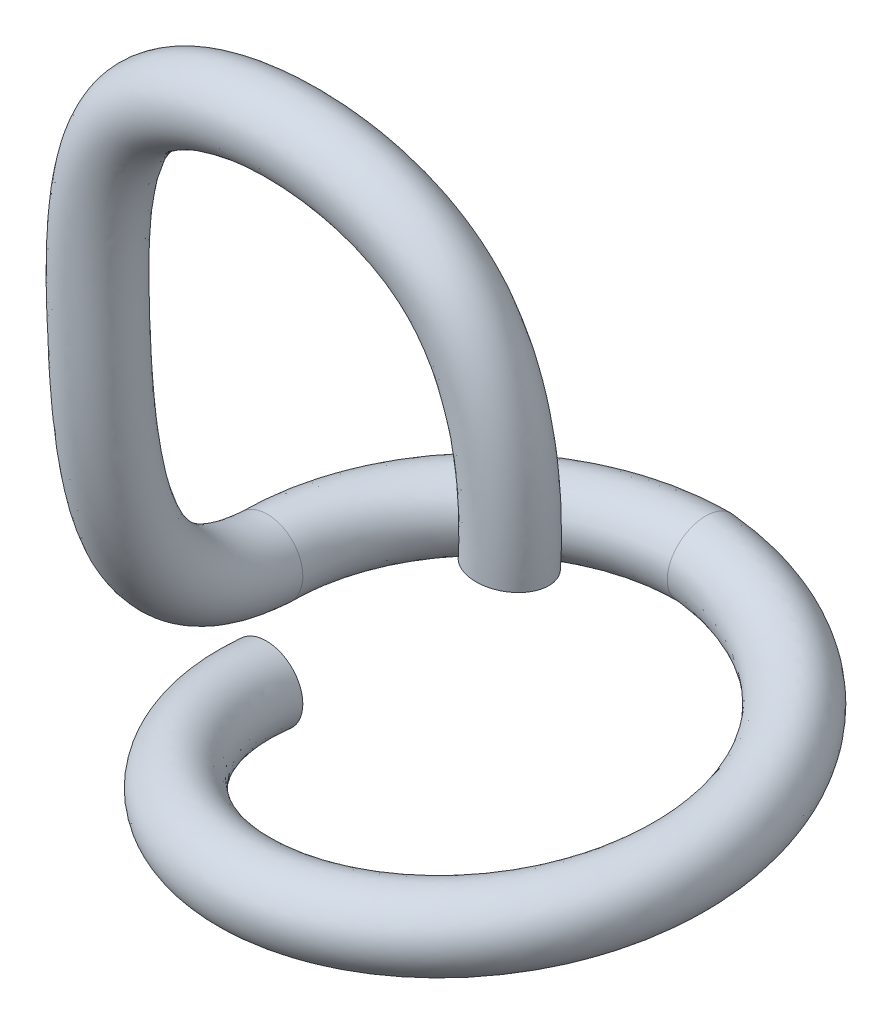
ISO-10303-21;
HEADER;
FILE_DESCRIPTION(('STEP AP214'),'2;1');
FILE_NAME('part.step','',(''),(''),'','','');
FILE_SCHEMA(('AUTOMOTIVE_DESIGN { 1 0 10303 214 1 1 1 1 }'));
ENDSEC;
DATA;
#1=APPLICATION_CONTEXT('core data for automotive mechanical design processes');
#2=APPLICATION_PROTOCOL_DEFINITION('international standard','automotive_design',2000,#1);
#3=PRODUCT_CONTEXT('',#1,'mechanical');
#4=PRODUCT('Part','Part','',(#3));
#5=PRODUCT_RELATED_PRODUCT_CATEGORY('part','',(#4));
#6=PRODUCT_DEFINITION_FORMATION('','',#4);
#7=PRODUCT_DEFINITION_CONTEXT('part definition',#1,'design');
#8=PRODUCT_DEFINITION('design','',#6,#7);
#9=PRODUCT_DEFINITION_SHAPE('','',#8);
#10=(LENGTH_UNIT() NAMED_UNIT(*) SI_UNIT(.MILLI.,.METRE.));
#11=(NAMED_UNIT(*) PLANE_ANGLE_UNIT() SI_UNIT($,.RADIAN.));
#12=(NAMED_UNIT(*) SI_UNIT($,.STERADIAN.) SOLID_ANGLE_UNIT());
#13=UNCERTAINTY_MEASURE_WITH_UNIT(LENGTH_MEASURE(1.E-05),#10,'distance_accuracy_value','');
#14=(GEOMETRIC_REPRESENTATION_CONTEXT(3) GLOBAL_UNCERTAINTY_ASSIGNED_CONTEXT((#13)) GLOBAL_UNIT_ASSIGNED_CONTEXT((#10,
#11,#12)) REPRESENTATION_CONTEXT('',''));
#15=CARTESIAN_POINT('',(0.,0.,0.));
#16=DIRECTION('',(0.,0.,1.));
#17=DIRECTION('',(1.,0.,0.));
#18=AXIS2_PLACEMENT_3D('',#15,#16,#17);
#19=CARTESIAN_POINT('',(2.63740427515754,5.38810300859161,2.30451896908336));
#20=DIRECTION('',(-0.0631399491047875,-0.992344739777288,0.106137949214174));
#21=DIRECTION('',(-0.997169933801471,0.0583805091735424,-0.0473691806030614));
#22=AXIS2_PLACEMENT_3D('',#19,#20,#21);
#23=PLANE('',#22);
#24=CARTESIAN_POINT('',(2.63740427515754,5.38810300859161,2.30451896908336));
#25=DIRECTION('',(-0.0631399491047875,-0.992344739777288,0.106137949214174));
#26=DIRECTION('',(-0.997169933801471,0.0583805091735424,-0.0473691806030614));
#27=AXIS2_PLACEMENT_3D('',#24,#25,#26);
#28=CIRCLE('',#27,0.5);
#29=CARTESIAN_POINT('',(2.13881930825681,5.41729326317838,2.28083437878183));
#30=VERTEX_POINT('',#29);
#31=EDGE_CURVE('E39',#30,#30,#28,.T.);
#32=ORIENTED_EDGE('',*,*,#31,.T.);
#33=EDGE_LOOP('',(#32));
#34=FACE_BOUND('',#33,.T.);
#35=ADVANCED_FACE('F36',(#34),#23,.T.);
#36=CARTESIAN_POINT('',(-3.,0.,0.));
#37=DIRECTION('',(0.,0.,1.));
#38=DIRECTION('',(1.,0.,0.));
#39=AXIS2_PLACEMENT_3D('',#36,#37,#38);
#40=PLANE('',#39);
#41=CARTESIAN_POINT('',(-3.,0.,0.));
#42=DIRECTION('',(0.,0.,1.));
#43=DIRECTION('',(1.,0.,0.));
#44=AXIS2_PLACEMENT_3D('',#41,#42,#43);
#45=CIRCLE('',#44,0.5);
#46=CARTESIAN_POINT('',(-2.5,0.,0.));
#47=VERTEX_POINT('',#46);
#48=EDGE_CURVE('E44',#47,#47,#45,.T.);
#49=ORIENTED_EDGE('',*,*,#48,.F.);
#50=EDGE_LOOP('',(#49));
#51=FACE_BOUND('',#50,.T.);
#52=ADVANCED_FACE('F108',(#51),#40,.F.);
#53=CARTESIAN_POINT('',(-2.49971436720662,1.48557837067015,-0.198761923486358));
#54=CARTESIAN_POINT('',(-2.49980975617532,1.49035302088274,-0.132266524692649));
#55=CARTESIAN_POINT('',(-2.49990523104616,1.49509809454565,-0.0657356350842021));
#56=CARTESIAN_POINT('',(-2.50017735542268,1.50881588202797,0.124031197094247));
#57=CARTESIAN_POINT('',(-2.50030352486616,1.52458197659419,0.240520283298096));
#58=CARTESIAN_POINT('',(-2.5004695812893,1.56873990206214,0.46089815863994));
#59=CARTESIAN_POINT('',(-2.50050944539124,1.59716826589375,0.564739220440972));
#60=CARTESIAN_POINT('',(-2.50052187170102,1.70021481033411,0.858346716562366));
#61=CARTESIAN_POINT('',(-2.50038726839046,1.79259179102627,1.03019875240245));
#62=CARTESIAN_POINT('',(-2.49973333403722,2.130545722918,1.48312611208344));
#63=CARTESIAN_POINT('',(-2.4989628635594,2.43697298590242,1.70164083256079));
#64=CARTESIAN_POINT('',(-2.49771517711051,3.15780370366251,2.01881352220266));
#65=CARTESIAN_POINT('',(-2.49722483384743,3.57218346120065,2.11767607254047));
#66=CARTESIAN_POINT('',(-2.49763104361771,4.45423357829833,2.23933678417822));
#67=CARTESIAN_POINT('',(-2.49883422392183,4.92183829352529,2.25718154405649));
#68=CARTESIAN_POINT('',(-2.50289257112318,5.95808532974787,2.2960157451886));
#69=CARTESIAN_POINT('',(-2.50360585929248,6.50419591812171,2.29912502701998));
#70=CARTESIAN_POINT('',(-2.36325802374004,7.40373082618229,2.2941334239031));
#71=CARTESIAN_POINT('',(-2.23006020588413,7.73692909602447,2.28728869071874));
#72=CARTESIAN_POINT('',(-1.68766574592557,8.28044810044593,2.27540135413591));
#73=CARTESIAN_POINT('',(-1.03517259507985,8.50618690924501,2.27143819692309));
#74=CARTESIAN_POINT('',(0.339879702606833,8.51160052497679,2.26807381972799));
#75=CARTESIAN_POINT('',(1.03518524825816,8.29656202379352,2.26788945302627));
#76=CARTESIAN_POINT('',(1.72326119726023,7.68351441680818,2.26924213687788));
#77=CARTESIAN_POINT('',(1.9186896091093,7.29709614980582,2.27040752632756));
#78=CARTESIAN_POINT('',(2.14251516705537,6.38714212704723,2.27262977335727));
#79=CARTESIAN_POINT('',(2.16587368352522,5.87399175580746,2.27417380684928));
#80=CARTESIAN_POINT('',(2.13881930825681,5.41729326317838,2.28083437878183));
#81=CARTESIAN_POINT('',(-2.4995684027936,2.48499950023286,-0.164741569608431));
#82=CARTESIAN_POINT('',(-2.4996637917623,2.48977415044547,-0.0982461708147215));
#83=CARTESIAN_POINT('',(-2.4997273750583,2.4941626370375,-0.0211910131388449));
#84=CARTESIAN_POINT('',(-2.50009056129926,2.50889860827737,0.138525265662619));
#85=CARTESIAN_POINT('',(-2.50040507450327,2.52446307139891,0.193621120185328));
#86=CARTESIAN_POINT('',(-2.50086536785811,2.56055931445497,0.325784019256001));
#87=CARTESIAN_POINT('',(-2.50107039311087,2.5817658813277,0.383283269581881));
#88=CARTESIAN_POINT('',(-2.50165281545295,2.65148292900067,0.535045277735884));
#89=CARTESIAN_POINT('',(-2.50200067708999,2.70509371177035,0.608711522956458));
#90=CARTESIAN_POINT('',(-2.50318151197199,2.8879970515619,0.799378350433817));
#91=CARTESIAN_POINT('',(-2.50404061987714,3.04828527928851,0.899829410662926));
#92=CARTESIAN_POINT('',(-2.50786444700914,3.54572367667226,1.08819802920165));
#93=CARTESIAN_POINT('',(-2.51037126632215,3.87766960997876,1.1637459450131));
#94=CARTESIAN_POINT('',(-2.52642654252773,4.64642243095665,1.25663053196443));
#95=CARTESIAN_POINT('',(-2.55013397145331,5.08075738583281,1.27108295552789));
#96=CARTESIAN_POINT('',(-2.55442513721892,6.08039491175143,1.3046539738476));
#97=CARTESIAN_POINT('',(-2.5512978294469,6.61587820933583,1.30644305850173));
#98=CARTESIAN_POINT('',(-2.38720042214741,7.50581184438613,1.29956257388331));
#99=CARTESIAN_POINT('',(-2.2288520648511,7.84093861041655,1.29213158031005));
#100=CARTESIAN_POINT('',(-1.60748232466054,8.36840959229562,1.28141783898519));
#101=CARTESIAN_POINT('',(-0.940604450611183,8.57599449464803,1.27818366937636));
#102=CARTESIAN_POINT('',(0.459948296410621,8.55257120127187,1.27596710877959));
#103=CARTESIAN_POINT('',(1.17003064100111,8.31997160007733,1.27639187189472));
#104=CARTESIAN_POINT('',(1.84588083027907,7.63355862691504,1.27753116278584));
#105=CARTESIAN_POINT('',(2.02341238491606,7.22419230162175,1.27838824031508));
#106=CARTESIAN_POINT('',(2.21769193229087,6.28848544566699,1.28015840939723));
#107=CARTESIAN_POINT('',(2.22738123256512,5.7688238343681,1.28140066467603));
#108=CARTESIAN_POINT('',(2.17962947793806,5.30846480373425,1.28761189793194));
#109=CARTESIAN_POINT('',(-3.49956733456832,2.48519485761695,-0.166190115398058));
#110=CARTESIAN_POINT('',(-3.49966272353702,2.48996950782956,-0.0996947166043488));
#111=CARTESIAN_POINT('',(-3.49972620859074,2.49440729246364,-0.0227007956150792));
#112=CARTESIAN_POINT('',(-3.50008967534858,2.50900250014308,0.137190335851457));
#113=CARTESIAN_POINT('',(-3.50040464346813,2.52430446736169,0.192652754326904));
#114=CARTESIAN_POINT('',(-3.50086522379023,2.56009224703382,0.3253707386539));
#115=CARTESIAN_POINT('',(-3.50107026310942,2.5811615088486,0.383172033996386));
#116=CARTESIAN_POINT('',(-3.50165222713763,2.65052622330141,0.535900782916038));
#117=CARTESIAN_POINT('',(-3.50199911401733,2.70398691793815,0.610289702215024));
#118=CARTESIAN_POINT('',(-3.50317425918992,2.88660680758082,0.803242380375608));
#119=CARTESIAN_POINT('',(-3.50402791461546,3.04687396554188,0.905238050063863));
#120=CARTESIAN_POINT('',(-3.50781330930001,3.5437269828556,1.09840199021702));
#121=CARTESIAN_POINT('',(-3.51031340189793,3.87515607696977,1.17679138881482));
#122=CARTESIAN_POINT('',(-3.52604076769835,4.6422781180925,1.28517875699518));
#123=CARTESIAN_POINT('',(-3.54881376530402,5.07563048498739,1.32219922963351));
#124=CARTESIAN_POINT('',(-3.55309818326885,6.07371525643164,1.35572508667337));
#125=CARTESIAN_POINT('',(-3.55625144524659,6.6528481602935,1.35923153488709));
#126=CARTESIAN_POINT('',(-3.35556153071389,7.77730252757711,1.35108630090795));
#127=CARTESIAN_POINT('',(-3.1386135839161,8.34375260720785,1.3381608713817));
#128=CARTESIAN_POINT('',(-2.0359968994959,9.35303291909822,1.32381103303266));
#129=CARTESIAN_POINT('',(-1.13903619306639,9.57407951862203,1.32694117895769));
#130=CARTESIAN_POINT('',(0.650788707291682,9.55141116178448,1.33781239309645));
#131=CARTESIAN_POINT('',(1.57456773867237,9.29553141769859,1.34652690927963));
#132=CARTESIAN_POINT('',(2.70447395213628,8.2043919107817,1.35043969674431));
#133=CARTESIAN_POINT('',(2.95916817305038,7.5961519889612,1.34859512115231));
#134=CARTESIAN_POINT('',(3.21957905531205,6.39346491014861,1.34437248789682));
#135=CARTESIAN_POINT('',(3.22831427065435,5.78492584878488,1.3413492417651));
#136=CARTESIAN_POINT('',(3.17679941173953,5.25008429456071,1.334981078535));
#137=CARTESIAN_POINT('',(-3.49971329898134,1.48577372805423,-0.200210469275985));
#138=CARTESIAN_POINT('',(-3.49980868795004,1.49054837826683,-0.133715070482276));
#139=CARTESIAN_POINT('',(-3.4999040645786,1.49534274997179,-0.0672454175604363));
#140=CARTESIAN_POINT('',(-3.500176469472,1.50891977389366,0.122696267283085));
#141=CARTESIAN_POINT('',(-3.50030309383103,1.52442337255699,0.239551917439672));
#142=CARTESIAN_POINT('',(-3.50046943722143,1.56827283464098,0.460484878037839));
#143=CARTESIAN_POINT('',(-3.50050931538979,1.59656389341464,0.564627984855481));
#144=CARTESIAN_POINT('',(-3.5005212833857,1.69925810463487,0.859202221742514));
#145=CARTESIAN_POINT('',(-3.50038570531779,1.79148499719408,1.03177693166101));
#146=CARTESIAN_POINT('',(-3.49972608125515,2.1291554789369,1.48699014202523));
#147=CARTESIAN_POINT('',(-3.49895015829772,2.43556167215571,1.70704947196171));
#148=CARTESIAN_POINT('',(-3.49766403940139,3.15580700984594,2.02901748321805));
#149=CARTESIAN_POINT('',(-3.49716696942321,3.56966992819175,2.13072151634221));
#150=CARTESIAN_POINT('',(-3.49724526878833,4.45008926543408,2.26788500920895));
#151=CARTESIAN_POINT('',(-3.49751401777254,4.91671139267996,2.30829781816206));
#152=CARTESIAN_POINT('',(-3.50156561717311,5.95140567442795,2.34708685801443));
#153=CARTESIAN_POINT('',(-3.50855947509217,6.54116586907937,2.3519135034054));
#154=CARTESIAN_POINT('',(-3.33161913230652,7.67522150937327,2.34565715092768));
#155=CARTESIAN_POINT('',(-3.13982172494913,8.23974309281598,2.33331798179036));
#156=CARTESIAN_POINT('',(-2.11618032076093,9.26507142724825,2.31779454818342));
#157=CARTESIAN_POINT('',(-1.23360433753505,9.50427193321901,2.32019570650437));
#158=CARTESIAN_POINT('',(0.530720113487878,9.5104404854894,2.32991910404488));
#159=CARTESIAN_POINT('',(1.43972234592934,9.27212184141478,2.33802449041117));
#160=CARTESIAN_POINT('',(2.5818543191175,8.25434770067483,2.34215067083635));
#161=CARTESIAN_POINT('',(2.85444539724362,7.66905583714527,2.34061440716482));
#162=CARTESIAN_POINT('',(3.14440229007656,6.49212159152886,2.33684385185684));
#163=CARTESIAN_POINT('',(3.16680672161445,5.89009377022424,2.33412238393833));
#164=CARTESIAN_POINT('',(3.13598924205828,5.35891275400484,2.32820355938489));
#165=CARTESIAN_POINT('',(-3.49985926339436,0.48635259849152,-0.234230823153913));
#166=CARTESIAN_POINT('',(-3.49995465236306,0.491127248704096,-0.167735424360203));
#167=CARTESIAN_POINT('',(-3.50008192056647,0.496278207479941,-0.111790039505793));
#168=CARTESIAN_POINT('',(-3.50026326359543,0.508837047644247,0.108202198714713));
#169=CARTESIAN_POINT('',(-3.50020154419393,0.524542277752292,0.286451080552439));
#170=CARTESIAN_POINT('',(-3.50007365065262,0.576453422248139,0.595599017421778));
#171=CARTESIAN_POINT('',(-3.49994836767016,0.611966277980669,0.746083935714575));
#172=CARTESIAN_POINT('',(-3.49939033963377,0.747989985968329,1.18250366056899));
#173=CARTESIAN_POINT('',(-3.49877229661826,0.878983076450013,1.453264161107));
#174=CARTESIAN_POINT('',(-3.49627790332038,1.37170415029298,2.17073790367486));
#175=CARTESIAN_POINT('',(-3.49387240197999,1.82424937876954,2.50886089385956));
#176=CARTESIAN_POINT('',(-3.48751476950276,2.76788703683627,2.95963297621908));
#177=CARTESIAN_POINT('',(-3.48402053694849,3.26418377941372,3.0846516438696));
#178=CARTESIAN_POINT('',(-3.46844976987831,4.25790041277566,3.25059126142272));
#179=CARTESIAN_POINT('',(-3.44621427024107,4.75779230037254,3.29439640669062));
#180=CARTESIAN_POINT('',(-3.45003305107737,5.82909609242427,3.3384486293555));
#181=CARTESIAN_POINT('',(-3.46086750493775,6.42948357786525,3.34459547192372));
#182=CARTESIAN_POINT('',(-3.30767673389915,7.57314049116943,3.34022800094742));
#183=CARTESIAN_POINT('',(-3.14102986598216,8.13573357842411,3.32847509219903));
#184=CARTESIAN_POINT('',(-2.19636374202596,9.17710993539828,3.31177806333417));
#185=CARTESIAN_POINT('',(-1.3281724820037,9.43446434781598,3.31345023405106));
#186=CARTESIAN_POINT('',(0.410651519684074,9.46946980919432,3.32202581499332));
#187=CARTESIAN_POINT('',(1.30487695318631,9.24871226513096,3.32952207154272));
#188=CARTESIAN_POINT('',(2.45923468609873,8.30430349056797,3.3338616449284));
#189=CARTESIAN_POINT('',(2.74972262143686,7.74195968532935,3.33263369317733));
#190=CARTESIAN_POINT('',(3.06922552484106,6.5907782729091,3.32931521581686));
#191=CARTESIAN_POINT('',(3.10529917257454,5.9952616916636,3.32689552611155));
#192=CARTESIAN_POINT('',(3.09517907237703,5.46774121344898,3.32142604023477));
#193=CARTESIAN_POINT('',(-2.49986033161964,0.486157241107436,-0.232782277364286));
#194=CARTESIAN_POINT('',(-2.49995572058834,0.490931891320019,-0.166286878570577));
#195=CARTESIAN_POINT('',(-2.50008308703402,0.496033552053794,-0.110280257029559));
#196=CARTESIAN_POINT('',(-2.50026414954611,0.508733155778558,0.109537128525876));
#197=CARTESIAN_POINT('',(-2.50020197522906,0.524700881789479,0.287419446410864));
#198=CARTESIAN_POINT('',(-2.5000737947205,0.576920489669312,0.59601229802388));
#199=CARTESIAN_POINT('',(-2.49994849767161,0.612570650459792,0.746195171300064));
#200=CARTESIAN_POINT('',(-2.49939092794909,0.748946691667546,1.18164815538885));
#201=CARTESIAN_POINT('',(-2.49877385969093,0.880089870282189,1.45168598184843));
#202=CARTESIAN_POINT('',(-2.49628515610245,1.3730943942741,2.16687387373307));
#203=CARTESIAN_POINT('',(-2.49388510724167,1.82566069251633,2.50345225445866));
#204=CARTESIAN_POINT('',(-2.48756590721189,2.76988373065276,2.94942901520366));
#205=CARTESIAN_POINT('',(-2.48407840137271,3.26669731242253,3.07160620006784));
#206=CARTESIAN_POINT('',(-2.46883554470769,4.26204472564,3.22204303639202));
#207=CARTESIAN_POINT('',(-2.44753447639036,4.76291920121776,3.2432801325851));
#208=CARTESIAN_POINT('',(-2.45136000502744,5.83577574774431,3.2873775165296));
#209=CARTESIAN_POINT('',(-2.45591388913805,6.39251362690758,3.29180699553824));
#210=CARTESIAN_POINT('',(-2.33931562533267,7.30164980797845,3.28870427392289));
#211=CARTESIAN_POINT('',(-2.23126834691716,7.63291958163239,3.28244580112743));
#212=CARTESIAN_POINT('',(-1.7678491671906,8.19248660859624,3.26938486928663));
#213=CARTESIAN_POINT('',(-1.12974073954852,8.43637932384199,3.26469272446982));
#214=CARTESIAN_POINT('',(0.219811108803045,8.47062984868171,3.26018053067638));
#215=CARTESIAN_POINT('',(0.900339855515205,8.2731524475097,3.25938703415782));
#216=CARTESIAN_POINT('',(1.60064156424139,7.73347020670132,3.26095311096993));
#217=CARTESIAN_POINT('',(1.81396683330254,7.36999999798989,3.26242681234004));
#218=CARTESIAN_POINT('',(2.06733840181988,6.48579880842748,3.26510113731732));
#219=CARTESIAN_POINT('',(2.10436613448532,5.97915967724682,3.26694694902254));
#220=CARTESIAN_POINT('',(2.09800913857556,5.52612172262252,3.27405685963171));
#221=CARTESIAN_POINT('',(-2.49971436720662,1.48557837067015,-0.198761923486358));
#222=CARTESIAN_POINT('',(-2.49980975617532,1.49035302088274,-0.132266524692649));
#223=CARTESIAN_POINT('',(-2.49990523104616,1.49509809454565,-0.0657356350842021));
#224=CARTESIAN_POINT('',(-2.50017735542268,1.50881588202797,0.124031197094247));
#225=CARTESIAN_POINT('',(-2.50030352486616,1.52458197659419,0.240520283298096));
#226=CARTESIAN_POINT('',(-2.5004695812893,1.56873990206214,0.46089815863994));
#227=CARTESIAN_POINT('',(-2.50050944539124,1.59716826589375,0.564739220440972));
#228=CARTESIAN_POINT('',(-2.50052187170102,1.70021481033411,0.858346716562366));
#229=CARTESIAN_POINT('',(-2.50038726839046,1.79259179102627,1.03019875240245));
#230=CARTESIAN_POINT('',(-2.49973333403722,2.130545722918,1.48312611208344));
#231=CARTESIAN_POINT('',(-2.4989628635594,2.43697298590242,1.70164083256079));
#232=CARTESIAN_POINT('',(-2.49771517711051,3.15780370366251,2.01881352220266));
#233=CARTESIAN_POINT('',(-2.49722483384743,3.57218346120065,2.11767607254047));
#234=CARTESIAN_POINT('',(-2.49763104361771,4.45423357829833,2.23933678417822));
#235=CARTESIAN_POINT('',(-2.49883422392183,4.92183829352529,2.25718154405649));
#236=CARTESIAN_POINT('',(-2.50289257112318,5.95808532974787,2.2960157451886));
#237=CARTESIAN_POINT('',(-2.50360585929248,6.50419591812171,2.29912502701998));
#238=CARTESIAN_POINT('',(-2.36325802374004,7.40373082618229,2.2941334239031));
#239=CARTESIAN_POINT('',(-2.23006020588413,7.73692909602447,2.28728869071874));
#240=CARTESIAN_POINT('',(-1.68766574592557,8.28044810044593,2.27540135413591));
#241=CARTESIAN_POINT('',(-1.03517259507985,8.50618690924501,2.27143819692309));
#242=CARTESIAN_POINT('',(0.339879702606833,8.51160052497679,2.26807381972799));
#243=CARTESIAN_POINT('',(1.03518524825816,8.29656202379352,2.26788945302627));
#244=CARTESIAN_POINT('',(1.72326119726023,7.68351441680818,2.26924213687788));
#245=CARTESIAN_POINT('',(1.9186896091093,7.29709614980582,2.27040752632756));
#246=CARTESIAN_POINT('',(2.14251516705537,6.38714212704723,2.27262977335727));
#247=CARTESIAN_POINT('',(2.16587368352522,5.87399175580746,2.27417380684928));
#248=CARTESIAN_POINT('',(2.13881930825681,5.41729326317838,2.28083437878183));
#249=(BOUNDED_SURFACE() B_SPLINE_SURFACE(3,3,((#53,#54,#55,#56,#57,#58,#59,#60,#61,#62,#63,#64,
#65,#66,#67,#68,#69,#70,#71,#72,#73,#74,#75,#76,#77,#78,#79,#80),(#81,#82,#83,#84,#85,#86,#87,
#88,#89,#90,#91,#92,#93,#94,#95,#96,#97,#98,#99,#100,#101,#102,#103,#104,#105,#106,#107,#108),
(#109,#110,#111,#112,#113,#114,#115,#116,#117,#118,#119,#120,#121,#122,#123,#124,#125,#126,#127,
#128,#129,#130,#131,#132,#133,#134,#135,#136),(#137,#138,#139,#140,#141,#142,#143,#144,#145,
#146,#147,#148,#149,#150,#151,#152,#153,#154,#155,#156,#157,#158,#159,#160,#161,#162,#163,#164),
(#165,#166,#167,#168,#169,#170,#171,#172,#173,#174,#175,#176,#177,#178,#179,#180,#181,#182,#183,
#184,#185,#186,#187,#188,#189,#190,#191,#192),(#193,#194,#195,#196,#197,#198,#199,#200,#201,
#202,#203,#204,#205,#206,#207,#208,#209,#210,#211,#212,#213,#214,#215,#216,#217,#218,#219,#220),
(#221,#222,#223,#224,#225,#226,#227,#228,#229,#230,#231,#232,#233,#234,#235,#236,#237,#238,#239,
#240,#241,#242,#243,#244,#245,#246,#247,#248)),.UNSPECIFIED.,.T.,.F.,
.F.) B_SPLINE_SURFACE_WITH_KNOTS((4,3,4),(4,2,2,2,2,2,2,2,2,2,2,2,2,4),(0.,0.5,1.),
(-0.0109498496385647,0.,0.0203158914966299,0.0406317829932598,0.0812635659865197,
0.162527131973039,0.243790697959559,0.325054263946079,0.424263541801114,0.52347281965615,
0.659328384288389,0.795183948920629,0.897591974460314,1.),
.UNSPECIFIED.) GEOMETRIC_REPRESENTATION_ITEM() RATIONAL_B_SPLINE_SURFACE(((1.,1.,1.,1.,1.,1.,1.,
1.,1.,1.,1.,1.,1.,1.,1.,1.,1.,1.,1.,1.,1.,1.,1.,1.,1.,1.,1.,1.),(0.333333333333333,
0.333333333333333,0.333333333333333,0.333333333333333,0.333333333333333,0.333333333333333,
0.333333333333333,0.333333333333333,0.333333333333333,0.333333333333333,0.333333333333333,
0.333333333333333,0.333333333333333,0.333333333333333,0.333333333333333,0.333333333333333,
0.333333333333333,0.333333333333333,0.333333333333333,0.333333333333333,0.333333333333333,
0.333333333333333,0.333333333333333,0.333333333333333,0.333333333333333,0.333333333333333,
0.333333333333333,0.333333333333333),(0.333333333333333,0.333333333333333,0.333333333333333,
0.333333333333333,0.333333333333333,0.333333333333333,0.333333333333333,0.333333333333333,
0.333333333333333,0.333333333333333,0.333333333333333,0.333333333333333,0.333333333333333,
0.333333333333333,0.333333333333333,0.333333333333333,0.333333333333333,0.333333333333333,
0.333333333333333,0.333333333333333,0.333333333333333,0.333333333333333,0.333333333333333,
0.333333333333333,0.333333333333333,0.333333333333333,0.333333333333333,0.333333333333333),(1.,
1.,1.,1.,1.,1.,1.,1.,1.,1.,1.,1.,1.,1.,1.,1.,1.,1.,1.,1.,1.,1.,1.,1.,1.,1.,1.,1.),
(0.333333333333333,0.333333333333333,0.333333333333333,0.333333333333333,0.333333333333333,
0.333333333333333,0.333333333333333,0.333333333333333,0.333333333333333,0.333333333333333,
0.333333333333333,0.333333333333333,0.333333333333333,0.333333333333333,0.333333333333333,
0.333333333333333,0.333333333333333,0.333333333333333,0.333333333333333,0.333333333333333,
0.333333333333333,0.333333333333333,0.333333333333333,0.333333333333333,0.333333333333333,
0.333333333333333,0.333333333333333,0.333333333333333),(0.333333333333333,0.333333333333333,
0.333333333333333,0.333333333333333,0.333333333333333,0.333333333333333,0.333333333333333,
0.333333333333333,0.333333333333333,0.333333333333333,0.333333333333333,0.333333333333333,
0.333333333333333,0.333333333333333,0.333333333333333,0.333333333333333,0.333333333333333,
0.333333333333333,0.333333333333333,0.333333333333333,0.333333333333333,0.333333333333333,
0.333333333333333,0.333333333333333,0.333333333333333,0.333333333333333,0.333333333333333,
0.333333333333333),(1.,1.,1.,1.,1.,1.,1.,1.,1.,1.,1.,1.,1.,1.,1.,1.,1.,1.,1.,1.,1.,1.,1.,1.,1.,
1.,1.,1.))) REPRESENTATION_ITEM('') SURFACE());
#250=CARTESIAN_POINT('',(-2.50007554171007,1.50864168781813,0.000118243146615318));
#251=CARTESIAN_POINT('',(-2.50006684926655,1.5081468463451,-0.000164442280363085));
#252=CARTESIAN_POINT('',(-2.50005911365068,1.50766408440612,-0.000145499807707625));
#253=CARTESIAN_POINT('',(-2.50004860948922,1.50693985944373,-3.63170072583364E-05));
#254=CARTESIAN_POINT('',(-2.50004529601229,1.50669884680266,1.33862501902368E-05));
#255=CARTESIAN_POINT('',(-2.50003895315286,1.50621196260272,7.84659246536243E-05));
#256=CARTESIAN_POINT('',(-2.50003592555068,1.5059660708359,9.36392913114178E-05));
#257=CARTESIAN_POINT('',(-2.50002746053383,1.50523412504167,0.000138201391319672));
#258=CARTESIAN_POINT('',(-2.50002256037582,1.50474826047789,0.00016698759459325));
#259=CARTESIAN_POINT('',(-2.5000141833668,1.50377581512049,0.0002154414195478));
#260=CARTESIAN_POINT('',(-2.50001070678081,1.50328923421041,0.000235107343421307));
#261=CARTESIAN_POINT('',(-2.49999693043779,1.50085777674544,0.000336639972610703));
#262=CARTESIAN_POINT('',(-2.49999741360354,1.49891340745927,0.00042826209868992));
#263=CARTESIAN_POINT('',(-2.50003336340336,1.49307745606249,0.000719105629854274));
#264=CARTESIAN_POINT('',(-2.5001033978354,1.48918689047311,0.000934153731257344));
#265=CARTESIAN_POINT('',(-2.500634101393,1.47141497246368,0.00191438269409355));
#266=CARTESIAN_POINT('',(-2.50163610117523,1.45754430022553,0.00267357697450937));
#267=CARTESIAN_POINT('',(-2.5048061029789,1.42993238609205,0.00414987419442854));
#268=CARTESIAN_POINT('',(-2.50697482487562,1.41619122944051,0.00486695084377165));
#269=CARTESIAN_POINT('',(-2.51522280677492,1.37526309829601,0.00694841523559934));
#270=CARTESIAN_POINT('',(-2.52304298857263,1.34840062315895,0.00824140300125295));
#271=CARTESIAN_POINT('',(-2.54307354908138,1.29640590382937,0.0106250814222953));
#272=CARTESIAN_POINT('',(-2.55527941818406,1.2712719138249,0.0117159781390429));
#273=CARTESIAN_POINT('',(-2.58372218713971,1.22340281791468,0.0136990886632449));
#274=CARTESIAN_POINT('',(-2.59995714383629,1.20066656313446,0.0145913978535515));
#275=CARTESIAN_POINT('',(-2.6360564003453,1.15814480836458,0.0161811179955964));
#276=CARTESIAN_POINT('',(-2.65593289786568,1.13836964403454,0.0168778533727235));
#277=CARTESIAN_POINT('',(-2.69871261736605,1.10240924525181,0.0180705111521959));
#278=CARTESIAN_POINT('',(-2.72161619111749,1.08622442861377,0.0185664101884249));
#279=CARTESIAN_POINT('',(-2.76990569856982,1.05783181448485,0.0193546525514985));
#280=CARTESIAN_POINT('',(-2.79530197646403,1.04564158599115,0.0196461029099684));
#281=CARTESIAN_POINT('',(-2.84780995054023,1.02565747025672,0.0200176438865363));
#282=CARTESIAN_POINT('',(-2.87492395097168,1.0178696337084,0.0200974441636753));
#283=CARTESIAN_POINT('',(-2.930160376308,1.00691282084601,0.0200432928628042));
#284=CARTESIAN_POINT('',(-2.95828576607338,1.00375879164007,0.0199086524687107));
#285=CARTESIAN_POINT('',(-3.01466586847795,1.0022048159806,0.0194299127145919));
#286=CARTESIAN_POINT('',(-3.04292058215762,1.00380490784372,0.0190858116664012));
#287=CARTESIAN_POINT('',(-3.09882157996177,1.01172504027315,0.0182035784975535));
#288=CARTESIAN_POINT('',(-3.12646638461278,1.01805548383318,0.0176650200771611));
#289=CARTESIAN_POINT('',(-3.1802575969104,1.03526264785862,0.0164248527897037));
#290=CARTESIAN_POINT('',(-3.20640600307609,1.04613313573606,0.015723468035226));
#291=CARTESIAN_POINT('',(-3.25648009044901,1.07210985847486,0.0142011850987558));
#292=CARTESIAN_POINT('',(-3.28040730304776,1.08721314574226,0.0133803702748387));
#293=CARTESIAN_POINT('',(-3.32536670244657,1.12123595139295,0.0116722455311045));
#294=CARTESIAN_POINT('',(-3.34639943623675,1.14015474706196,0.0107849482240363));
#295=CARTESIAN_POINT('',(-3.38487823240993,1.18118249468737,0.00900379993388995));
#296=CARTESIAN_POINT('',(-3.40233953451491,1.20327717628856,0.00810999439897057));
#297=CARTESIAN_POINT('',(-3.4333017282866,1.25013101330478,0.0063600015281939));
#298=CARTESIAN_POINT('',(-3.44679930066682,1.27489237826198,0.00550384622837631));
#299=CARTESIAN_POINT('',(-3.46417699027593,1.3144165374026,0.00424509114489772));
#300=CARTESIAN_POINT('',(-3.46961916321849,1.32851245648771,0.00381571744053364));
#301=CARTESIAN_POINT('',(-3.47919786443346,1.35714928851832,0.00298041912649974));
#302=CARTESIAN_POINT('',(-3.48333407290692,1.3716903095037,0.00257450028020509));
#303=CARTESIAN_POINT('',(-3.49025268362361,1.40105606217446,0.00179057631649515));
#304=CARTESIAN_POINT('',(-3.49303832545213,1.41588002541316,0.00141250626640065));
#305=CARTESIAN_POINT('',(-3.49619438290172,1.4382503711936,0.000857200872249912));
#306=CARTESIAN_POINT('',(-3.49707592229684,1.44572794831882,0.000674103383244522));
#307=CARTESIAN_POINT('',(-3.49849730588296,1.46071536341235,0.00031621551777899));
#308=CARTESIAN_POINT('',(-3.49903721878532,1.46822519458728,0.00014142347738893));
#309=CARTESIAN_POINT('',(-3.49947080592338,1.47706983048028,-0.000100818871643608));
#310=CARTESIAN_POINT('',(-3.499530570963,1.47839839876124,-0.00013817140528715));
#311=CARTESIAN_POINT('',(-3.49963938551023,1.48105564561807,-0.000218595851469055));
#312=CARTESIAN_POINT('',(-3.49968843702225,1.48238432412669,-0.00026166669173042));
#313=CARTESIAN_POINT('',(-3.4997539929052,1.4843776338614,-0.000343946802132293));
#314=CARTESIAN_POINT('',(-3.49977451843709,1.48504254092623,-0.000374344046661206));
#315=CARTESIAN_POINT('',(-3.49981285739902,1.48637139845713,-0.000446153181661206));
#316=CARTESIAN_POINT('',(-3.4998306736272,1.48703534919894,-0.000487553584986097));
#317=CARTESIAN_POINT('',(-3.49985559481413,1.48803934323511,-0.000587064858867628));
#318=CARTESIAN_POINT('',(-3.49986371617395,1.48838090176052,-0.000627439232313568));
#319=CARTESIAN_POINT('',(-3.49987526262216,1.48888869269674,-0.000705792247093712));
#320=CARTESIAN_POINT('',(-3.49987898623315,1.48905626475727,-0.00073466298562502));
#321=CARTESIAN_POINT('',(-3.49988614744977,1.48938604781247,-0.000812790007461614));
#322=CARTESIAN_POINT('',(-3.49988958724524,1.48954829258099,-0.00086186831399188));
#323=CARTESIAN_POINT('',(-3.49990649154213,1.49036487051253,-0.00109165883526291));
#324=CARTESIAN_POINT('',(-3.49991836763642,1.49100329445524,-0.00121477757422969));
#325=CARTESIAN_POINT('',(-3.49993009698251,1.4916857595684,-0.000343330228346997));
#326=B_SPLINE_CURVE_WITH_KNOTS('',3,(#250,#251,#252,#253,#254,#255,#256,#257,#258,#259,#260,
#261,#262,#263,#264,#265,#266,#267,#268,#269,#270,#271,#272,#273,#274,#275,#276,#277,#278,#279,
#280,#281,#282,#283,#284,#285,#286,#287,#288,#289,#290,#291,#292,#293,#294,#295,#296,#297,#298,
#299,#300,#301,#302,#303,#304,#305,#306,#307,#308,#309,#310,#311,#312,#313,#314,#315,#316,#317,
#318,#319,#320,#321,#322,#323,#324,#325),.UNSPECIFIED.,.F.,.F.,(4,2,2,2,2,2,2,2,2,2,2,2,2,2,2,2,
2,2,2,2,2,2,2,2,2,2,2,2,2,2,2,2,2,2,2,2,2,4),(0.,0.00147356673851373,0.00220786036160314,
0.00294646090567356,0.0044070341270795,0.00586787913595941,0.0117074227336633,
0.0233980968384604,0.0651223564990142,0.106872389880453,0.190459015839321,0.27395993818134,
0.357420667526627,0.441166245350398,0.52492156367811,0.609040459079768,0.693274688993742,
0.777780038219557,0.862286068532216,0.946978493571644,1.03155503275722,1.11607282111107,
1.20057461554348,1.28470794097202,1.36891152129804,1.4142061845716,1.45951193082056,
1.50470845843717,1.52729711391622,1.54988122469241,1.55387256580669,1.55786315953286,
1.55986099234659,1.5618567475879,1.56288830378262,1.5633983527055,1.5639040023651,
1.56595946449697),.UNSPECIFIED.);
#327=CARTESIAN_POINT('',(-2.50007554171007,1.50864168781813,0.000118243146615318));
#328=VERTEX_POINT('',#327);
#329=CARTESIAN_POINT('',(-3.49993009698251,1.4916857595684,-0.000343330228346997));
#330=VERTEX_POINT('',#329);
#331=EDGE_CURVE('E63',#328,#330,#326,.T.);
#332=CARTESIAN_POINT('',(-2.50007554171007,1.50864168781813,0.000118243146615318));
#333=CARTESIAN_POINT('',(-2.50021034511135,1.51642283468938,-0.000125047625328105));
#334=CARTESIAN_POINT('',(-2.50053048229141,1.52420425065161,-0.000369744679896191));
#335=CARTESIAN_POINT('',(-2.50283527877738,1.55973047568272,-0.00149078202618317));
#336=CARTESIAN_POINT('',(-2.50698330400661,1.58736631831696,-0.00237363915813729));
#337=CARTESIAN_POINT('',(-2.51987510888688,1.64159281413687,-0.00407781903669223));
#338=CARTESIAN_POINT('',(-2.52862909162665,1.66818100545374,-0.00489900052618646));
#339=CARTESIAN_POINT('',(-2.55046795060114,1.71948118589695,-0.00647786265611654));
#340=CARTESIAN_POINT('',(-2.56354729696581,1.7441955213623,-0.00723562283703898));
#341=CARTESIAN_POINT('',(-2.59366275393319,1.79108715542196,-0.00866495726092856));
#342=CARTESIAN_POINT('',(-2.61069929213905,1.81326417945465,-0.00933652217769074));
#343=CARTESIAN_POINT('',(-2.64828373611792,1.85451162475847,-0.010580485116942));
#344=CARTESIAN_POINT('',(-2.66883993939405,1.8735744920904,-0.0111526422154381));
#345=CARTESIAN_POINT('',(-2.71285033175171,1.90800308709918,-0.0121845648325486));
#346=CARTESIAN_POINT('',(-2.73630487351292,1.92336836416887,-0.0126443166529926));
#347=CARTESIAN_POINT('',(-2.78555552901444,1.95003680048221,-0.0134481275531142));
#348=CARTESIAN_POINT('',(-2.81136151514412,1.96132174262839,-0.0137916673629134));
#349=CARTESIAN_POINT('',(-2.8645308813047,1.9794362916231,-0.0143607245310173));
#350=CARTESIAN_POINT('',(-2.89189625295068,1.98626005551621,-0.0145860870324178));
#351=CARTESIAN_POINT('',(-2.94748513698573,1.99525844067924,-0.0149223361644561));
#352=CARTESIAN_POINT('',(-2.97571143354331,1.99741588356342,-0.0150327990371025));
#353=CARTESIAN_POINT('',(-3.03212677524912,1.99697098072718,-0.0151423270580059));
#354=CARTESIAN_POINT('',(-3.06031582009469,1.99436859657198,-0.0151413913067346));
#355=CARTESIAN_POINT('',(-3.11592136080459,1.98446397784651,-0.0150308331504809));
#356=CARTESIAN_POINT('',(-3.14333598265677,1.97715121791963,-0.0149209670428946));
#357=CARTESIAN_POINT('',(-3.19650938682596,1.95803092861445,-0.0145913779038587));
#358=CARTESIAN_POINT('',(-3.22227028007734,1.94622926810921,-0.0143717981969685));
#359=CARTESIAN_POINT('',(-3.27141678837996,1.9184705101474,-0.0138168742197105));
#360=CARTESIAN_POINT('',(-3.2948044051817,1.90251695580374,-0.0134816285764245));
#361=CARTESIAN_POINT('',(-3.33855106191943,1.8669002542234,-0.0126836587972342));
#362=CARTESIAN_POINT('',(-3.35891065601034,1.84723778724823,-0.0122209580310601));
#363=CARTESIAN_POINT('',(-3.39594061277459,1.80483942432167,-0.011153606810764));
#364=CARTESIAN_POINT('',(-3.41262516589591,1.78211591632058,-0.010549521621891));
#365=CARTESIAN_POINT('',(-3.44191729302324,1.73419008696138,-0.00917933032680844));
#366=CARTESIAN_POINT('',(-3.45452522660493,1.70898798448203,-0.00841323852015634));
#367=CARTESIAN_POINT('',(-3.47569014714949,1.65580877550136,-0.0066682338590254));
#368=CARTESIAN_POINT('',(-3.48407563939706,1.62776272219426,-0.00568236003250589));
#369=CARTESIAN_POINT('',(-3.49284785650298,1.58499657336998,-0.00404790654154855));
#370=CARTESIAN_POINT('',(-3.49513727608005,1.57063684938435,-0.00347766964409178));
#371=CARTESIAN_POINT('',(-3.4984422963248,1.54177603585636,-0.00228929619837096));
#372=CARTESIAN_POINT('',(-3.49945885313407,1.52727506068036,-0.00167119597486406));
#373=CARTESIAN_POINT('',(-3.49987882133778,1.51105700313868,-0.00093029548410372));
#374=CARTESIAN_POINT('',(-3.49991420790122,1.5093462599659,-0.000851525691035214));
#375=CARTESIAN_POINT('',(-3.49996127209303,1.50630768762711,-0.000709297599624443));
#376=CARTESIAN_POINT('',(-3.49997648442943,1.50497989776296,-0.000646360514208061));
#377=CARTESIAN_POINT('',(-3.49999619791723,1.5023239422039,-0.000517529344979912));
#378=CARTESIAN_POINT('',(-3.50000069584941,1.50099577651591,-0.000451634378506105));
#379=CARTESIAN_POINT('',(-3.49999940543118,1.49900225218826,-0.000348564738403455));
#380=CARTESIAN_POINT('',(-3.49999762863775,1.49833671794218,-0.000313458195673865));
#381=CARTESIAN_POINT('',(-3.49999138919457,1.49700655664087,-0.000238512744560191));
#382=CARTESIAN_POINT('',(-3.49998693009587,1.49634192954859,-0.000198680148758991));
#383=CARTESIAN_POINT('',(-3.49997818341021,1.49533685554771,-0.000100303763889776));
#384=CARTESIAN_POINT('',(-3.4999748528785,1.49499485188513,-6.00849643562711E-05));
#385=CARTESIAN_POINT('',(-3.49996938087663,1.49448637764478,1.7986448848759E-05));
#386=CARTESIAN_POINT('',(-3.49996748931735,1.4943185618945,4.67592822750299E-05));
#387=CARTESIAN_POINT('',(-3.49996360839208,1.49398824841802,0.000124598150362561));
#388=CARTESIAN_POINT('',(-3.49996162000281,1.49382571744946,0.000173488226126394));
#389=CARTESIAN_POINT('',(-3.49995119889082,1.49300797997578,0.000402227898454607));
#390=CARTESIAN_POINT('',(-3.49994168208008,1.49236855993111,0.000524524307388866));
#391=CARTESIAN_POINT('',(-3.49993009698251,1.4916857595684,-0.000343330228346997));
#392=B_SPLINE_CURVE_WITH_KNOTS('',3,(#332,#333,#334,#335,#336,#337,#338,#339,#340,#341,#342,
#343,#344,#345,#346,#347,#348,#349,#350,#351,#352,#353,#354,#355,#356,#357,#358,#359,#360,#361,
#362,#363,#364,#365,#366,#367,#368,#369,#370,#371,#372,#373,#374,#375,#376,#377,#378,#379,#380,
#381,#382,#383,#384,#385,#386,#387,#388,#389,#390,#391),.UNSPECIFIED.,.F.,.F.,(4,2,2,2,2,2,2,2,
2,2,2,2,2,2,2,2,2,2,2,2,2,2,2,2,2,2,2,2,2,4),(0.,0.0233659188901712,0.106804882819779,
0.190429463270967,0.273947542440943,0.357474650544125,0.441201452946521,0.524938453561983,
0.609044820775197,0.693261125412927,0.777786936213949,0.86231342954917,0.947029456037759,
1.03163510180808,1.11616878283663,1.20068697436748,1.28487286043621,1.36905131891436,
1.45641768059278,1.50003071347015,1.54361096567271,1.5487497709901,1.55273783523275,
1.55672709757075,1.55872661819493,1.56072349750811,1.56175605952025,1.56226669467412,
1.562772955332,1.56482988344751),.UNSPECIFIED.);
#393=EDGE_CURVE('E67',#328,#330,#392,.T.);
#394=ORIENTED_EDGE('',*,*,#331,.F.);
#395=ORIENTED_EDGE('',*,*,#393,.T.);
#396=EDGE_LOOP('',(#394,#395));
#397=FACE_BOUND('',#396,.T.);
#398=ORIENTED_EDGE('',*,*,#31,.F.);
#399=EDGE_LOOP('',(#398));
#400=FACE_BOUND('',#399,.T.);
#401=ADVANCED_FACE('F65',(#397,#400),#249,.T.);
#402=CARTESIAN_POINT('',(0.273937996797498,1.49987635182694,-2.50000001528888));
#403=CARTESIAN_POINT('',(0.182625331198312,1.49987635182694,-2.50000001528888));
#404=CARTESIAN_POINT('',(0.0837030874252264,1.49987635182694,-2.50000635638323));
#405=CARTESIAN_POINT('',(-0.180492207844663,1.49987635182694,-2.49998634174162));
#406=CARTESIAN_POINT('',(-0.327737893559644,1.49987635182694,-2.48382313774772));
#407=CARTESIAN_POINT('',(-0.648783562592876,1.49987635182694,-2.41989036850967));
#408=CARTESIAN_POINT('',(-0.806139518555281,1.49987635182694,-2.37211166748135));
#409=CARTESIAN_POINT('',(-1.25961341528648,1.49987635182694,-2.18414114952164));
#410=CARTESIAN_POINT('',(-1.53636761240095,1.49987635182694,-1.99916631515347));
#411=CARTESIAN_POINT('',(-1.99916631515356,1.49987635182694,-1.53636761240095));
#412=CARTESIAN_POINT('',(-2.18414114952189,1.49987635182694,-1.25961341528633));
#413=CARTESIAN_POINT('',(-2.37211166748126,1.49987635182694,-0.806139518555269));
#414=CARTESIAN_POINT('',(-2.41989036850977,1.49987635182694,-0.648783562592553));
#415=CARTESIAN_POINT('',(-2.48382313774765,1.49987635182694,-0.327737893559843));
#416=CARTESIAN_POINT('',(-2.49998634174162,1.49987635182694,-0.180492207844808));
#417=CARTESIAN_POINT('',(-2.50000593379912,1.49987635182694,0.0781249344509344));
#418=CARTESIAN_POINT('',(-2.50000001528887,1.49987635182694,0.170454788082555));
#419=CARTESIAN_POINT('',(-2.50000001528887,1.49987635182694,0.255682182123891));
#420=CARTESIAN_POINT('',(0.168426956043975,2.49429445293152,-2.49975409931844));
#421=CARTESIAN_POINT('',(0.0771142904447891,2.49429445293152,-2.49975409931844));
#422=CARTESIAN_POINT('',(-0.0218119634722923,2.49429445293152,-2.50136618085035));
#423=CARTESIAN_POINT('',(-0.285994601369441,2.49429445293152,-2.49627790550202));
#424=CARTESIAN_POINT('',(-0.432533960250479,2.49429445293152,-2.46974682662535));
#425=CARTESIAN_POINT('',(-0.750849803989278,2.49429445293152,-2.39227080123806));
#426=CARTESIAN_POINT('',(-0.906173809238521,2.49429445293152,-2.33785568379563));
#427=CARTESIAN_POINT('',(-1.3516699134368,2.49429445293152,-2.13076505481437));
#428=CARTESIAN_POINT('',(-1.62059013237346,2.49429445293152,-1.93412816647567));
#429=CARTESIAN_POINT('',(-2.06381116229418,2.49429445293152,-1.45184283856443));
#430=CARTESIAN_POINT('',(-2.23708755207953,2.49429445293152,-1.16730910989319));
#431=CARTESIAN_POINT('',(-2.40590097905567,2.49429445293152,-0.705946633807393));
#432=CARTESIAN_POINT('',(-2.4470338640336,2.49429445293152,-0.546589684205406));
#433=CARTESIAN_POINT('',(-2.49741079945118,2.49429445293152,-0.222877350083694));
#434=CARTESIAN_POINT('',(-2.50320294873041,2.49429445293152,-0.0749736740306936));
#435=CARTESIAN_POINT('',(-2.49826128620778,2.49429445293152,0.183632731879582));
#436=CARTESIAN_POINT('',(-2.49975409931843,2.49429445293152,0.275965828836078));
#437=CARTESIAN_POINT('',(-2.49975409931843,2.49429445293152,0.361193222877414));
#438=CARTESIAN_POINT('',(0.168426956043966,2.49454174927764,-3.4997540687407));
#439=CARTESIAN_POINT('',(0.0771142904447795,2.49454174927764,-3.4997540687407));
#440=CARTESIAN_POINT('',(-0.00659326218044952,2.49454174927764,-3.50136868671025));
#441=CARTESIAN_POINT('',(-0.318811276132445,2.49454174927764,-3.4962724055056));
#442=CARTESIAN_POINT('',(-0.563629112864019,2.49454174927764,-3.4632760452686));
#443=CARTESIAN_POINT('',(-1.01036321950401,2.49454174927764,-3.36022691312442));
#444=CARTESIAN_POINT('',(-1.22862960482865,2.49454174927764,-3.28670031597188));
#445=CARTESIAN_POINT('',(-1.85551526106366,2.49454174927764,-3.00442148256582));
#446=CARTESIAN_POINT('',(-2.23513715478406,2.49454174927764,-2.73379466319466));
#447=CARTESIAN_POINT('',(-2.86347765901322,2.49454174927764,-2.06638986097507));
#448=CARTESIAN_POINT('',(-3.11074397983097,2.49454174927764,-1.67115445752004));
#449=CARTESIAN_POINT('',(-3.35474561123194,2.49454174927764,-1.02840242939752));
#450=CARTESIAN_POINT('',(-3.41498997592,2.49454174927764,-0.806103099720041));
#451=CARTESIAN_POINT('',(-3.49094001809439,2.49454174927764,-0.35397250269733));
#452=CARTESIAN_POINT('',(-3.50319744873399,2.49454174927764,-0.107790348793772));
#453=CARTESIAN_POINT('',(-3.49826362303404,2.49454174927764,0.197837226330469));
#454=CARTESIAN_POINT('',(-3.49975406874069,2.49454174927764,0.275965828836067));
#455=CARTESIAN_POINT('',(-3.49975406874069,2.49454174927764,0.361193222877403));
#456=CARTESIAN_POINT('',(0.273937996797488,1.50012364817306,-3.49999998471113));
#457=CARTESIAN_POINT('',(0.182625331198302,1.50012364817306,-3.49999998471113));
#458=CARTESIAN_POINT('',(0.0989217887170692,1.50012364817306,-3.50000886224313));
#459=CARTESIAN_POINT('',(-0.213308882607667,1.50012364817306,-3.4999808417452));
#460=CARTESIAN_POINT('',(-0.458833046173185,1.50012364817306,-3.47735235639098));
#461=CARTESIAN_POINT('',(-0.908296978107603,1.50012364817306,-3.38784648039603));
#462=CARTESIAN_POINT('',(-1.1285953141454,1.50012364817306,-3.32095629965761));
#463=CARTESIAN_POINT('',(-1.76345876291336,1.50012364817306,-3.05779757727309));
#464=CARTESIAN_POINT('',(-2.15091463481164,1.50012364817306,-2.79883281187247));
#465=CARTESIAN_POINT('',(-2.79883281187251,1.50012364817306,-2.15091463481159));
#466=CARTESIAN_POINT('',(-3.05779757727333,1.50012364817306,-1.76345876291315));
#467=CARTESIAN_POINT('',(-3.32095629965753,1.50012364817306,-1.12859531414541));
#468=CARTESIAN_POINT('',(-3.38784648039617,1.50012364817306,-0.908296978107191));
#469=CARTESIAN_POINT('',(-3.47735235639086,1.50012364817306,-0.458833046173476));
#470=CARTESIAN_POINT('',(-3.4999808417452,1.50012364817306,-0.213308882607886));
#471=CARTESIAN_POINT('',(-3.50000827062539,1.50012364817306,0.0923294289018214));
#472=CARTESIAN_POINT('',(-3.49999998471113,1.50012364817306,0.170454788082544));
#473=CARTESIAN_POINT('',(-3.49999998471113,1.50012364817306,0.25568218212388));
#474=CARTESIAN_POINT('',(0.379449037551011,0.505705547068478,-3.50024590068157));
#475=CARTESIAN_POINT('',(0.288136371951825,0.505705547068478,-3.50024590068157));
#476=CARTESIAN_POINT('',(0.204436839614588,0.505705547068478,-3.498649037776));
#477=CARTESIAN_POINT('',(-0.107806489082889,0.505705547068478,-3.5036892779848));
#478=CARTESIAN_POINT('',(-0.354036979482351,0.505705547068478,-3.49142866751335));
#479=CARTESIAN_POINT('',(-0.806230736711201,0.505705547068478,-3.41546604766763));
#480=CARTESIAN_POINT('',(-1.02856102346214,0.505705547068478,-3.35521228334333));
#481=CARTESIAN_POINT('',(-1.67140226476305,0.505705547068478,-3.11117367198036));
#482=CARTESIAN_POINT('',(-2.06669211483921,0.505705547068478,-2.86387096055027));
#483=CARTESIAN_POINT('',(-2.7341879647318,0.505705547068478,-2.23543940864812));
#484=CARTESIAN_POINT('',(-3.00485117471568,0.505705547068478,-1.85576306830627));
#485=CARTESIAN_POINT('',(-3.28716698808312,0.505705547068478,-1.2287881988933));
#486=CARTESIAN_POINT('',(-3.36070298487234,0.505705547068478,-1.01049085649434));
#487=CARTESIAN_POINT('',(-3.46376469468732,0.505705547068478,-0.563693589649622));
#488=CARTESIAN_POINT('',(-3.49676423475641,0.505705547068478,-0.318827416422));
#489=CARTESIAN_POINT('',(-3.50175291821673,0.505705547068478,-0.0131783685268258));
#490=CARTESIAN_POINT('',(-3.50024590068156,0.505705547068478,0.0649437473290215));
#491=CARTESIAN_POINT('',(-3.50024590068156,0.505705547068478,0.150171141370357));
#492=CARTESIAN_POINT('',(0.379449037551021,0.505458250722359,-2.50024593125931));
#493=CARTESIAN_POINT('',(0.288136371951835,0.505458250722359,-2.50024593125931));
#494=CARTESIAN_POINT('',(0.189218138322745,0.505458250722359,-2.4986465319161));
#495=CARTESIAN_POINT('',(-0.0749898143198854,0.505458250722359,-2.50369477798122));
#496=CARTESIAN_POINT('',(-0.22294182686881,0.505458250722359,-2.4978994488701));
#497=CARTESIAN_POINT('',(-0.546717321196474,0.505458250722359,-2.44750993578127));
#498=CARTESIAN_POINT('',(-0.706105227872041,0.505458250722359,-2.40636765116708));
#499=CARTESIAN_POINT('',(-1.16755691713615,0.505458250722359,-2.23751724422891));
#500=CARTESIAN_POINT('',(-1.45214509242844,0.505458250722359,-2.06420446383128));
#501=CARTESIAN_POINT('',(-1.93452146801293,0.505458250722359,-1.62089238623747));
#502=CARTESIAN_POINT('',(-2.13119474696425,0.505458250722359,-1.35191772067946));
#503=CARTESIAN_POINT('',(-2.33832235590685,0.505458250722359,-0.906332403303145));
#504=CARTESIAN_POINT('',(-2.39274687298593,0.505458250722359,-0.7509774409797));
#505=CARTESIAN_POINT('',(-2.47023547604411,0.505458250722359,-0.432598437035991));
#506=CARTESIAN_POINT('',(-2.49676973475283,0.505458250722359,-0.286010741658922));
#507=CARTESIAN_POINT('',(-2.50175058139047,0.505458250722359,-0.0273828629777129));
#508=CARTESIAN_POINT('',(-2.50024593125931,0.505458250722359,0.0649437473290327));
#509=CARTESIAN_POINT('',(-2.50024593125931,0.505458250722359,0.150171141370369));
#510=CARTESIAN_POINT('',(0.273937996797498,1.49987635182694,-2.50000001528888));
#511=CARTESIAN_POINT('',(0.182625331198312,1.49987635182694,-2.50000001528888));
#512=CARTESIAN_POINT('',(0.0837030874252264,1.49987635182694,-2.50000635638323));
#513=CARTESIAN_POINT('',(-0.180492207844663,1.49987635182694,-2.49998634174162));
#514=CARTESIAN_POINT('',(-0.327737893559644,1.49987635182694,-2.48382313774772));
#515=CARTESIAN_POINT('',(-0.648783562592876,1.49987635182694,-2.41989036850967));
#516=CARTESIAN_POINT('',(-0.806139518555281,1.49987635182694,-2.37211166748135));
#517=CARTESIAN_POINT('',(-1.25961341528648,1.49987635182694,-2.18414114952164));
#518=CARTESIAN_POINT('',(-1.53636761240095,1.49987635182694,-1.99916631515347));
#519=CARTESIAN_POINT('',(-1.99916631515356,1.49987635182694,-1.53636761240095));
#520=CARTESIAN_POINT('',(-2.18414114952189,1.49987635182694,-1.25961341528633));
#521=CARTESIAN_POINT('',(-2.37211166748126,1.49987635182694,-0.806139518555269));
#522=CARTESIAN_POINT('',(-2.41989036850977,1.49987635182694,-0.648783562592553));
#523=CARTESIAN_POINT('',(-2.48382313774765,1.49987635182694,-0.327737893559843));
#524=CARTESIAN_POINT('',(-2.49998634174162,1.49987635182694,-0.180492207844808));
#525=CARTESIAN_POINT('',(-2.50000593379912,1.49987635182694,0.0781249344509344));
#526=CARTESIAN_POINT('',(-2.50000001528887,1.49987635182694,0.170454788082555));
#527=CARTESIAN_POINT('',(-2.50000001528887,1.49987635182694,0.255682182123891));
#528=(BOUNDED_SURFACE() B_SPLINE_SURFACE(3,3,((#402,#403,#404,#405,#406,#407,#408,#409,#410,
#411,#412,#413,#414,#415,#416,#417,#418,#419),(#420,#421,#422,#423,#424,#425,#426,#427,#428,
#429,#430,#431,#432,#433,#434,#435,#436,#437),(#438,#439,#440,#441,#442,#443,#444,#445,#446,
#447,#448,#449,#450,#451,#452,#453,#454,#455),(#456,#457,#458,#459,#460,#461,#462,#463,#464,
#465,#466,#467,#468,#469,#470,#471,#472,#473),(#474,#475,#476,#477,#478,#479,#480,#481,#482,
#483,#484,#485,#486,#487,#488,#489,#490,#491),(#492,#493,#494,#495,#496,#497,#498,#499,#500,
#501,#502,#503,#504,#505,#506,#507,#508,#509),(#510,#511,#512,#513,#514,#515,#516,#517,#518,
#519,#520,#521,#522,#523,#524,#525,#526,#527)),.UNSPECIFIED.,.T.,.F.,
.F.) B_SPLINE_SURFACE_WITH_KNOTS((4,3,4),(4,2,2,2,2,2,2,2,4),(0.,0.5,1.),(-0.0579686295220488,
0.,0.125,0.25,0.5,0.75,0.875,1.,1.05410547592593),
.UNSPECIFIED.) GEOMETRIC_REPRESENTATION_ITEM() RATIONAL_B_SPLINE_SURFACE(((1.,1.,1.,1.,1.,1.,1.,
1.,1.,1.,1.,1.,1.,1.,1.,1.,1.,1.),(0.333333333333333,0.333333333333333,0.333333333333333,
0.333333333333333,0.333333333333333,0.333333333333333,0.333333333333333,0.333333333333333,
0.333333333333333,0.333333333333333,0.333333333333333,0.333333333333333,0.333333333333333,
0.333333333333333,0.333333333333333,0.333333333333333,0.333333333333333,0.333333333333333),
(0.333333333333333,0.333333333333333,0.333333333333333,0.333333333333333,0.333333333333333,
0.333333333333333,0.333333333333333,0.333333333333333,0.333333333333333,0.333333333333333,
0.333333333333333,0.333333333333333,0.333333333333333,0.333333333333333,0.333333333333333,
0.333333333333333,0.333333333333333,0.333333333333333),(1.,1.,1.,1.,1.,1.,1.,1.,1.,1.,1.,1.,1.,
1.,1.,1.,1.,1.),(0.333333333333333,0.333333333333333,0.333333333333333,0.333333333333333,
0.333333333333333,0.333333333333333,0.333333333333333,0.333333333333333,0.333333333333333,
0.333333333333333,0.333333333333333,0.333333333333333,0.333333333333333,0.333333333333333,
0.333333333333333,0.333333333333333,0.333333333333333,0.333333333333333),(0.333333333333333,
0.333333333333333,0.333333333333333,0.333333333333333,0.333333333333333,0.333333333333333,
0.333333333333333,0.333333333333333,0.333333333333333,0.333333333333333,0.333333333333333,
0.333333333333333,0.333333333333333,0.333333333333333,0.333333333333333,0.333333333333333,
0.333333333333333,0.333333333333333),(1.,1.,1.,1.,1.,1.,1.,1.,1.,1.,1.,1.,1.,1.,1.,1.,1.,1.))) REPRESENTATION_ITEM('') SURFACE());
#529=CARTESIAN_POINT('',(-6.54459418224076E-06,1.49987629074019,-2.50000001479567));
#530=CARTESIAN_POINT('',(-0.0014798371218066,1.4720274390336,-2.50000438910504));
#531=CARTESIAN_POINT('',(-0.00295214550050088,1.44419719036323,-2.50237266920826));
#532=CARTESIAN_POINT('',(-0.00585709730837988,1.38928645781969,-2.51176091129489));
#533=CARTESIAN_POINT('',(-0.00728969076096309,1.36220691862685,-2.51878647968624));
#534=CARTESIAN_POINT('',(-0.0100710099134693,1.30963314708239,-2.53728437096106));
#535=CARTESIAN_POINT('',(-0.0114197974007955,1.28413774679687,-2.54875337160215));
#536=CARTESIAN_POINT('',(-0.0139969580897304,1.23542307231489,-2.57580490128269));
#537=CARTESIAN_POINT('',(-0.0152253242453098,1.21220393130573,-2.59138767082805));
#538=CARTESIAN_POINT('',(-0.0175300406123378,1.16863912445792,-2.62626128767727));
#539=CARTESIAN_POINT('',(-0.0186060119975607,1.14830061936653,-2.64556110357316));
#540=CARTESIAN_POINT('',(-0.0205725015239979,1.11112913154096,-2.68729317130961));
#541=CARTESIAN_POINT('',(-0.0214630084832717,1.09429636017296,-2.70972561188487));
#542=CARTESIAN_POINT('',(-0.0230369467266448,1.06454505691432,-2.75717826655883));
#543=CARTESIAN_POINT('',(-0.0237195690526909,1.05164181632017,-2.78220809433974));
#544=CARTESIAN_POINT('',(-0.0248549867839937,1.03017962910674,-2.83410993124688));
#545=CARTESIAN_POINT('',(-0.0253074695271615,1.02162659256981,-2.86098439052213));
#546=CARTESIAN_POINT('',(-0.0259697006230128,1.0091087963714,-2.91586927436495));
#547=CARTESIAN_POINT('',(-0.0261787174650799,1.0051578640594,-2.94388286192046));
#548=CARTESIAN_POINT('',(-0.026345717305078,1.00200115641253,-3.00017825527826));
#549=CARTESIAN_POINT('',(-0.0263036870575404,1.0027956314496,-3.02846007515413));
#550=CARTESIAN_POINT('',(-0.0259694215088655,1.00911407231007,-3.08452725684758));
#551=CARTESIAN_POINT('',(-0.0256768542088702,1.0146443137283,-3.11231190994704));
#552=CARTESIAN_POINT('',(-0.0248490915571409,1.03029106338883,-3.16655654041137));
#553=CARTESIAN_POINT('',(-0.0243138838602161,1.04040780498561,-3.19301645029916));
#554=CARTESIAN_POINT('',(-0.0230170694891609,1.06492078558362,-3.24380022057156));
#555=CARTESIAN_POINT('',(-0.0222559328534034,1.07930813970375,-3.26812838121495));
#556=CARTESIAN_POINT('',(-0.020526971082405,1.11198976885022,-3.31404268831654));
#557=CARTESIAN_POINT('',(-0.0195588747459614,1.13028917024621,-3.33562517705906));
#558=CARTESIAN_POINT('',(-0.0174482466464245,1.17018523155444,-3.37530499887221));
#559=CARTESIAN_POINT('',(-0.0163064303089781,1.19176836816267,-3.39341596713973));
#560=CARTESIAN_POINT('',(-0.0138778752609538,1.23767403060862,-3.42573585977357));
#561=CARTESIAN_POINT('',(-0.0125911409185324,1.26199647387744,-3.43994490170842));
#562=CARTESIAN_POINT('',(-0.00991446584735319,1.31259221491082,-3.46400286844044));
#563=CARTESIAN_POINT('',(-0.00852493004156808,1.33885785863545,-3.47386793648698));
#564=CARTESIAN_POINT('',(-0.00567787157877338,1.39267426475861,-3.48903015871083));
#565=CARTESIAN_POINT('',(-0.00422034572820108,1.42022508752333,-3.49432709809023));
#566=CARTESIAN_POINT('',(-0.00128267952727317,1.47575420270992,-3.50019172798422));
#567=CARTESIAN_POINT('',(0.000197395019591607,1.503731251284,-3.50077123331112));
#568=CARTESIAN_POINT('',(0.00314153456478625,1.55938272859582,-3.49721332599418));
#569=CARTESIAN_POINT('',(0.00460560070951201,1.58705717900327,-3.49307625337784));
#570=CARTESIAN_POINT('',(0.00747500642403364,1.641296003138,-3.48021137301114));
#571=CARTESIAN_POINT('',(0.00888039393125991,1.66786128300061,-3.4714873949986));
#572=CARTESIAN_POINT('',(0.0115940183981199,1.71915545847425,-3.44970319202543));
#573=CARTESIAN_POINT('',(0.0129022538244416,1.74388432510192,-3.43664289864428));
#574=CARTESIAN_POINT('',(0.015387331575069,1.79085840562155,-3.40653027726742));
#575=CARTESIAN_POINT('',(0.0165638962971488,1.81309837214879,-3.38946974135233));
#576=CARTESIAN_POINT('',(0.0187480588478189,1.85438441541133,-3.35188565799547));
#577=CARTESIAN_POINT('',(0.0197558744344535,1.87343460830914,-3.3313666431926));
#578=CARTESIAN_POINT('',(0.0215800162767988,1.90791537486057,-3.28734628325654));
#579=CARTESIAN_POINT('',(0.0223955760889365,1.9233314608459,-3.2638335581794));
#580=CARTESIAN_POINT('',(0.0238074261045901,1.95001889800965,-3.21455892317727));
#581=CARTESIAN_POINT('',(0.0244037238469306,1.9612903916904,-3.18879709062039));
#582=CARTESIAN_POINT('',(0.0253624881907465,1.97941339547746,-3.13565108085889));
#583=CARTESIAN_POINT('',(0.0257240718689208,1.98624821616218,-3.10826119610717));
#584=CARTESIAN_POINT('',(0.0261999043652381,1.99524262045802,-3.05272334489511));
#585=CARTESIAN_POINT('',(0.0263141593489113,1.99740232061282,-3.02457539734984));
#586=CARTESIAN_POINT('',(0.0262922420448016,1.99698802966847,-2.96821706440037));
#587=CARTESIAN_POINT('',(0.0261552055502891,1.99439770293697,-2.94000679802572));
#588=CARTESIAN_POINT('',(0.0256332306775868,1.98453109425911,-2.88445934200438));
#589=CARTESIAN_POINT('',(0.0252486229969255,1.97726106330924,-2.8571210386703));
#590=CARTESIAN_POINT('',(0.0242418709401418,1.95823097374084,-2.80401919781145));
#591=CARTESIAN_POINT('',(0.0236194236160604,1.9464651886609,-2.77825771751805));
#592=CARTESIAN_POINT('',(0.0221544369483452,1.91877333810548,-2.72908516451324));
#593=CARTESIAN_POINT('',(0.0213119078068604,1.9028474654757,-2.70567398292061));
#594=CARTESIAN_POINT('',(0.0194323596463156,1.86731938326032,-2.66192113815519));
#595=CARTESIAN_POINT('',(0.0183957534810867,1.84772497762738,-2.64157312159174));
#596=CARTESIAN_POINT('',(0.0161561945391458,1.80539180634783,-2.60447799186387));
#597=CARTESIAN_POINT('',(0.0149532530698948,1.78265325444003,-2.58773063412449));
#598=CARTESIAN_POINT('',(0.0124195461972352,1.73475996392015,-2.55837828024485));
#599=CARTESIAN_POINT('',(0.0110892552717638,1.70961419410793,-2.54575862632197));
#600=CARTESIAN_POINT('',(0.00833745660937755,1.65759843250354,-2.52496139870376));
#601=CARTESIAN_POINT('',(0.00691606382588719,1.63073061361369,-2.51677834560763));
#602=CARTESIAN_POINT('',(0.00367022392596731,1.56937625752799,-2.50366669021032));
#603=CARTESIAN_POINT('',(0.00183107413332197,1.53461180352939,-2.49999455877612));
#604=CARTESIAN_POINT('',(-6.54459418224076E-06,1.49987629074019,-2.50000001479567));
#605=B_SPLINE_CURVE_WITH_KNOTS('',3,(#529,#530,#531,#532,#533,#534,#535,#536,#537,#538,#539,
#540,#541,#542,#543,#544,#545,#546,#547,#548,#549,#550,#551,#552,#553,#554,#555,#556,#557,#558,
#559,#560,#561,#562,#563,#564,#565,#566,#567,#568,#569,#570,#571,#572,#573,#574,#575,#576,#577,
#578,#579,#580,#581,#582,#583,#584,#585,#586,#587,#588,#589,#590,#591,#592,#593,#594,#595,#596,
#597,#598,#599,#600,#601,#602,#603,#604),.UNSPECIFIED.,.T.,.F.,(4,2,2,2,2,2,2,2,2,2,2,2,2,2,2,2,
2,2,2,2,2,2,2,2,2,2,2,2,2,2,2,2,2,2,2,2,2,4),(0.,0.083533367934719,0.167167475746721,
0.250739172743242,0.334315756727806,0.418096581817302,0.501882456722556,0.585990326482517,
0.67021215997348,0.754686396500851,0.839165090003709,0.923755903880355,1.00835102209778,
1.09277136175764,1.17730301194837,1.26149551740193,1.34568548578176,1.42955988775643,
1.51343823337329,1.59710644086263,1.68076861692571,1.76436105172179,1.84795480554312,
1.9317216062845,2.01537946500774,2.09936539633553,2.18334843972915,2.26764559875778,
2.35194065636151,2.43652615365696,2.52099889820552,2.60557960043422,2.69015638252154,
2.77455525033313,2.85894838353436,2.94303849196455,3.02702450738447,3.13121459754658),.UNSPECIFIED.);
#606=CARTESIAN_POINT('',(-6.54621910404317E-06,1.49987632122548,-2.50000001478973));
#607=VERTEX_POINT('',#606);
#608=EDGE_CURVE('E11',#607,#607,#605,.T.);
#609=ORIENTED_EDGE('',*,*,#393,.F.);
#610=ORIENTED_EDGE('',*,*,#331,.T.);
#611=EDGE_LOOP('',(#609,#610));
#612=FACE_BOUND('',#611,.T.);
#613=ORIENTED_EDGE('',*,*,#608,.F.);
#614=EDGE_LOOP('',(#613));
#615=FACE_BOUND('',#614,.T.);
#616=ADVANCED_FACE('F70',(#612,#615),#528,.T.);
#617=CARTESIAN_POINT('',(-2.5,0.,0.));
#618=CARTESIAN_POINT('',(-2.49999999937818,0.0410697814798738,0.323525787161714));
#619=CARTESIAN_POINT('',(-2.43441403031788,0.0835317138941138,0.655080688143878));
#620=CARTESIAN_POINT('',(-2.18473235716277,0.166264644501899,1.25894372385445));
#621=CARTESIAN_POINT('',(-1.9987512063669,0.208530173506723,1.53692853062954));
#622=CARTESIAN_POINT('',(-1.53700358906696,0.291442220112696,1.99838455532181));
#623=CARTESIAN_POINT('',(-1.25812791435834,0.333534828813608,2.18480921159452));
#624=CARTESIAN_POINT('',(-0.655169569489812,0.416284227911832,2.43463805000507));
#625=CARTESIAN_POINT('',(-0.326400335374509,0.458537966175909,2.50001110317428));
#626=CARTESIAN_POINT('',(0.326378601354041,0.541365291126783,2.49998890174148));
#627=CARTESIAN_POINT('',(0.655194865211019,0.583535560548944,2.43458815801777));
#628=CARTESIAN_POINT('',(1.25824234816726,0.666332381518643,2.18480120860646));
#629=CARTESIAN_POINT('',(1.53698992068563,0.70853370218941,1.99854516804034));
#630=CARTESIAN_POINT('',(1.99855321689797,0.791343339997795,1.53697951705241));
#631=CARTESIAN_POINT('',(2.18480773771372,0.833544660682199,1.25823092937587));
#632=CARTESIAN_POINT('',(2.43459161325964,0.916341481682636,0.655182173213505));
#633=CARTESIAN_POINT('',(2.49999057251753,0.958511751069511,0.326365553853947));
#634=CARTESIAN_POINT('',(2.50000943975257,1.04133907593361,-0.326413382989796));
#635=CARTESIAN_POINT('',(2.43463458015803,1.08359281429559,-0.655182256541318));
#636=CARTESIAN_POINT('',(2.18480267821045,1.16634221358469,-1.25813933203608));
#637=CARTESIAN_POINT('',(1.99837652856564,1.20843482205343,-1.53701401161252));
#638=CARTESIAN_POINT('',(1.53691812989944,1.29134686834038,-1.99875925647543));
#639=CARTESIAN_POINT('',(1.25893228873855,1.33361239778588,-2.18473885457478));
#640=CARTESIAN_POINT('',(0.806034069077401,1.39566209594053,-2.37199782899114));
#641=CARTESIAN_POINT('',(0.647703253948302,1.41657836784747,-2.41975226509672));
#642=CARTESIAN_POINT('',(0.325547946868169,1.45843980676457,-2.48375714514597));
#643=CARTESIAN_POINT('',(0.178422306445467,1.4792586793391,-2.49998667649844));
#644=CARTESIAN_POINT('',(-0.0606436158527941,1.50688295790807,-2.50000454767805));
#645=CARTESIAN_POINT('',(-0.132602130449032,1.51394518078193,-2.50000001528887));
#646=CARTESIAN_POINT('',(-0.198896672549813,1.52097925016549,-2.50000001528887));
#647=CARTESIAN_POINT('',(-2.5,1.,0.));
#648=CARTESIAN_POINT('',(-2.49933468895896,1.04106978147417,0.323509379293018));
#649=CARTESIAN_POINT('',(-2.43491336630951,1.08353184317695,0.655271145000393));
#650=CARTESIAN_POINT('',(-2.18388042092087,1.16626447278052,1.25854013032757));
#651=CARTESIAN_POINT('',(-1.99899078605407,1.20853018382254,1.53719214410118));
#652=CARTESIAN_POINT('',(-1.53672413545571,1.29144220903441,1.99808273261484));
#653=CARTESIAN_POINT('',(-1.25829033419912,1.33353491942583,2.18518595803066));
#654=CARTESIAN_POINT('',(-0.654909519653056,1.4162841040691,2.43391003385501));
#655=CARTESIAN_POINT('',(-0.326394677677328,1.45853801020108,2.50041621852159));
#656=CARTESIAN_POINT('',(0.326351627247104,1.54136523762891,2.49939030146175));
#657=CARTESIAN_POINT('',(0.655349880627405,1.58353562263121,2.43496034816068));
#658=CARTESIAN_POINT('',(1.25795760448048,1.66633230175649,2.18419687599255));
#659=CARTESIAN_POINT('',(1.53727389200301,1.70853375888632,1.99882488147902));
#660=CARTESIAN_POINT('',(1.99807656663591,1.79134326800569,1.53654470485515));
#661=CARTESIAN_POINT('',(2.1851973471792,1.83354471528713,1.25839145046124));
#662=CARTESIAN_POINT('',(2.43397975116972,1.91634141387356,0.654963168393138));
#663=CARTESIAN_POINT('',(2.50034325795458,1.95851181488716,0.326359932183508));
#664=CARTESIAN_POINT('',(2.49935840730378,2.04133898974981,-0.326386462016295));
#665=CARTESIAN_POINT('',(2.43512292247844,2.08359285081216,-0.655378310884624));
#666=CARTESIAN_POINT('',(2.18421123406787,2.16634217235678,-1.25785263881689));
#667=CARTESIAN_POINT('',(1.99848141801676,2.20843488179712,-1.5371426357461));
#668=CARTESIAN_POINT('',(1.53650355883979,2.29134676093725,-1.99832284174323));
#669=CARTESIAN_POINT('',(1.25921168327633,2.33361242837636,-2.18537603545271));
#670=CARTESIAN_POINT('',(0.805913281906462,2.39566207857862,-2.37160280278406));
#671=CARTESIAN_POINT('',(0.647620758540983,2.41657830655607,-2.41938177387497));
#672=CARTESIAN_POINT('',(0.325538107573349,2.45843981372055,-2.48367067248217));
#673=CARTESIAN_POINT('',(0.178418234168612,2.4792586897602,-2.49990666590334));
#674=CARTESIAN_POINT('',(-0.0606422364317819,2.5068829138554,-2.4997022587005));
#675=CARTESIAN_POINT('',(-0.132602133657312,2.51394515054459,-2.49975409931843));
#676=CARTESIAN_POINT('',(-0.198896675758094,2.52097921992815,-2.49975409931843));
#677=CARTESIAN_POINT('',(-3.5,1.,0.));
#678=CARTESIAN_POINT('',(-3.49933468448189,1.04173509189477,0.456875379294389));
#679=CARTESIAN_POINT('',(-3.40988091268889,1.082993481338,0.914388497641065));
#680=CARTESIAN_POINT('',(-3.05717448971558,1.16721011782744,1.76357514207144));
#681=CARTESIAN_POINT('',(-2.79941469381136,1.20817444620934,2.15104015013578));
#682=CARTESIAN_POINT('',(-2.15007201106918,1.29185315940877,2.79888992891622));
#683=CARTESIAN_POINT('',(-1.7636506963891,1.33312175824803,3.05823253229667));
#684=CARTESIAN_POINT('',(-0.915155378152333,1.41705915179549,3.40852332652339));
#685=CARTESIAN_POINT('',(-0.458886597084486,1.4581314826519,3.50041914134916));
#686=CARTESIAN_POINT('',(0.458887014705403,1.54196525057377,3.49938736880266));
#687=CARTESIAN_POINT('',(0.915545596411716,1.58313038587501,3.4095729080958));
#688=CARTESIAN_POINT('',(1.76308865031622,1.66700165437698,3.05735997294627));
#689=CARTESIAN_POINT('',(2.15064730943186,1.70813341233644,2.79966266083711));
#690=CARTESIAN_POINT('',(2.79889824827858,1.79198953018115,2.14993892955));
#691=CARTESIAN_POINT('',(3.05834738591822,1.83312127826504,1.76354533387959));
#692=CARTESIAN_POINT('',(3.40858540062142,1.91699256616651,0.915184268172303));
#693=CARTESIAN_POINT('',(3.50033698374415,1.95815771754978,0.458921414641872));
#694=CARTESIAN_POINT('',(3.499364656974,2.04199143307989,-0.45885228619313));
#695=CARTESIAN_POINT('',(3.40974315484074,2.08306371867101,-0.915598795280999));
#696=CARTESIAN_POINT('',(3.05727087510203,2.16700124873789,-1.76319016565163));
#697=CARTESIAN_POINT('',(2.7993046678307,2.20826984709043,-2.15046966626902));
#698=CARTESIAN_POINT('',(2.15037236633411,2.29194841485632,-2.79873064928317));
#699=CARTESIAN_POINT('',(1.76426956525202,2.3329126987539,-3.05865710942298));
#700=CARTESIAN_POINT('',(1.12653480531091,2.39607535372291,-3.32114354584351));
#701=CARTESIAN_POINT('',(0.905983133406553,2.41695781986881,-3.38759435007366));
#702=CARTESIAN_POINT('',(0.456970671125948,2.4585264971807,-3.47710528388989));
#703=CARTESIAN_POINT('',(0.211784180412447,2.47933870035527,-3.49990014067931));
#704=CARTESIAN_POINT('',(-0.0719446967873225,2.50718520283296,-3.49970443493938));
#705=CARTESIAN_POINT('',(-0.132576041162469,2.51419106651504,-3.49975406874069));
#706=CARTESIAN_POINT('',(-0.19887058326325,2.52122513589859,-3.49975406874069));
#707=CARTESIAN_POINT('',(-3.5,0.,0.));
#708=CARTESIAN_POINT('',(-3.4999999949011,0.0417350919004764,0.456891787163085));
#709=CARTESIAN_POINT('',(-3.40938157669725,0.0829933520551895,0.91419804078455));
#710=CARTESIAN_POINT('',(-3.05802642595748,0.167210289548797,1.76397873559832));
#711=CARTESIAN_POINT('',(-2.79917511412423,0.208174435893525,2.15077653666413));
#712=CARTESIAN_POINT('',(-2.15035146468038,0.291853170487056,2.79919175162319));
#713=CARTESIAN_POINT('',(-1.76348827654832,0.333121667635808,3.05785578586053));
#714=CARTESIAN_POINT('',(-0.915415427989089,0.417059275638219,3.40925134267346));
#715=CARTESIAN_POINT('',(-0.458892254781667,0.458131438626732,3.50001402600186));
#716=CARTESIAN_POINT('',(0.45891398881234,0.541965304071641,3.49998596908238));
#717=CARTESIAN_POINT('',(0.915390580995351,0.583130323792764,3.40920071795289));
#718=CARTESIAN_POINT('',(1.76337339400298,0.667001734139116,3.05796430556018));
#719=CARTESIAN_POINT('',(2.15036333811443,0.708133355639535,2.79938294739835));
#720=CARTESIAN_POINT('',(2.79937489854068,0.791989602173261,2.15037374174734));
#721=CARTESIAN_POINT('',(3.05795777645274,0.833121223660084,1.76338481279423));
#722=CARTESIAN_POINT('',(3.40919726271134,0.916992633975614,0.915403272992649));
#723=CARTESIAN_POINT('',(3.4999842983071,0.958157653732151,0.458927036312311));
#724=CARTESIAN_POINT('',(3.5000156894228,1.04199151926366,-0.458879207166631));
#725=CARTESIAN_POINT('',(3.40925481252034,1.08306368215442,-0.915402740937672));
#726=CARTESIAN_POINT('',(3.05786231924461,1.16700128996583,-1.76347685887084));
#727=CARTESIAN_POINT('',(2.79919977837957,1.2082697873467,-2.15034104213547));
#728=CARTESIAN_POINT('',(2.15078693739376,1.29194852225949,-2.79916706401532));
#729=CARTESIAN_POINT('',(1.76399017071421,1.3329126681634,-3.05801992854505));
#730=CARTESIAN_POINT('',(1.12665559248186,1.39607537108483,-3.32153857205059));
#731=CARTESIAN_POINT('',(0.906065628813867,1.4169578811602,-3.38796484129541));
#732=CARTESIAN_POINT('',(0.456980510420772,1.45852649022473,-3.47719175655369));
#733=CARTESIAN_POINT('',(0.211788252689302,1.47933868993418,-3.49998015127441));
#734=CARTESIAN_POINT('',(-0.0719460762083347,1.50718524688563,-3.50000672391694));
#735=CARTESIAN_POINT('',(-0.132576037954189,1.51419109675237,-3.49999998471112));
#736=CARTESIAN_POINT('',(-0.19887058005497,1.52122516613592,-3.49999998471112));
#737=CARTESIAN_POINT('',(-3.5,-1.,0.));
#738=CARTESIAN_POINT('',(-3.50066530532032,-0.958264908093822,0.456908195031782));
#739=CARTESIAN_POINT('',(-3.40888224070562,-0.917006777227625,0.914007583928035));
#740=CARTESIAN_POINT('',(-3.05887836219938,-0.832789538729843,1.76438232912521));
#741=CARTESIAN_POINT('',(-2.7989355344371,-0.791825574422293,2.15051292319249));
#742=CARTESIAN_POINT('',(-2.15063091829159,-0.708146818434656,2.79949357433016));
#743=CARTESIAN_POINT('',(-1.76332585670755,-0.666878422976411,3.0574790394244));
#744=CARTESIAN_POINT('',(-0.915675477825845,-0.582940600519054,3.40997935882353));
#745=CARTESIAN_POINT('',(-0.458897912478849,-0.54186860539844,3.49960891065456));
#746=CARTESIAN_POINT('',(0.458940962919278,-0.458034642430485,3.50058456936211));
#747=CARTESIAN_POINT('',(0.915235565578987,-0.41686973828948,3.40882852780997));
#748=CARTESIAN_POINT('',(1.76365813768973,-0.332998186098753,3.05856863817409));
#749=CARTESIAN_POINT('',(2.150079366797,-0.291866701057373,2.79910323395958));
#750=CARTESIAN_POINT('',(2.79985154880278,-0.20801032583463,2.15080855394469));
#751=CARTESIAN_POINT('',(3.05756816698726,-0.166878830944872,1.76322429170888));
#752=CARTESIAN_POINT('',(3.40980912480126,-0.0830072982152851,0.915622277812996));
#753=CARTESIAN_POINT('',(3.49963161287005,-0.0418424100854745,0.45893265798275));
#754=CARTESIAN_POINT('',(3.50066672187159,0.0419916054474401,-0.458906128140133));
#755=CARTESIAN_POINT('',(3.40876647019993,0.0830636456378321,-0.915206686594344));
#756=CARTESIAN_POINT('',(3.05845376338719,0.167001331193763,-1.76376355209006));
#757=CARTESIAN_POINT('',(2.79909488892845,0.208269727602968,-2.15021241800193));
#758=CARTESIAN_POINT('',(2.15120150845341,0.29194862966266,-2.79960347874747));
#759=CARTESIAN_POINT('',(1.76371077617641,0.332912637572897,-3.05738274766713));
#760=CARTESIAN_POINT('',(1.12677637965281,0.396075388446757,-3.32193359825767));
#761=CARTESIAN_POINT('',(0.90614812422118,0.416957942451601,-3.38833533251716));
#762=CARTESIAN_POINT('',(0.456990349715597,0.458526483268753,-3.47727822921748));
#763=CARTESIAN_POINT('',(0.211792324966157,0.479338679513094,-3.50006016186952));
#764=CARTESIAN_POINT('',(-0.071947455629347,0.50718529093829,-3.50030901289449));
#765=CARTESIAN_POINT('',(-0.132576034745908,0.514191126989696,-3.50024590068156));
#766=CARTESIAN_POINT('',(-0.19887057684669,0.521225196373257,-3.50024590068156));
#767=CARTESIAN_POINT('',(-2.5,-1.,0.));
#768=CARTESIAN_POINT('',(-2.50066530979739,-0.958930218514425,0.32354219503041));
#769=CARTESIAN_POINT('',(-2.43391469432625,-0.916468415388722,0.654890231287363));
#770=CARTESIAN_POINT('',(-2.18558429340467,-0.83373518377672,1.25934731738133));
#771=CARTESIAN_POINT('',(-1.99851162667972,-0.791469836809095,1.5366649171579));
#772=CARTESIAN_POINT('',(-1.53728304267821,-0.708557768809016,1.99868637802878));
#773=CARTESIAN_POINT('',(-1.25796549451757,-0.66646526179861,2.18443246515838));
#774=CARTESIAN_POINT('',(-0.655429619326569,-0.583715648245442,2.43536606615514));
#775=CARTESIAN_POINT('',(-0.32640599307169,-0.541462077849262,2.49960598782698));
#776=CARTESIAN_POINT('',(0.326405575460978,-0.458634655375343,2.5005875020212));
#777=CARTESIAN_POINT('',(0.655039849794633,-0.41646450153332,2.43421596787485));
#778=CARTESIAN_POINT('',(1.25852709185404,-0.333667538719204,2.18540554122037));
#779=CARTESIAN_POINT('',(1.53670594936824,-0.291466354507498,1.99826545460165));
#780=CARTESIAN_POINT('',(1.99902986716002,-0.208656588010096,1.53741432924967));
#781=CARTESIAN_POINT('',(2.18441812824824,-0.166455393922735,1.25807040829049));
#782=CARTESIAN_POINT('',(2.43520347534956,-0.083658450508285,0.655401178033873));
#783=CARTESIAN_POINT('',(2.49963788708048,-0.0414883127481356,0.326371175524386));
#784=CARTESIAN_POINT('',(2.50066047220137,0.0413391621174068,-0.326440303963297));
#785=CARTESIAN_POINT('',(2.43414623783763,0.0835927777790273,-0.654986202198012));
#786=CARTESIAN_POINT('',(2.18539412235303,0.166342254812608,-1.25842602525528));
#787=CARTESIAN_POINT('',(1.99827163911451,0.208434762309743,-1.53688538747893));
#788=CARTESIAN_POINT('',(1.53733270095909,0.291346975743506,-1.99919567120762));
#789=CARTESIAN_POINT('',(1.25865289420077,0.333612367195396,-2.18410167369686));
#790=CARTESIAN_POINT('',(0.806154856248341,0.395662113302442,-2.37239285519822));
#791=CARTESIAN_POINT('',(0.647785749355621,0.416578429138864,-2.42012275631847));
#792=CARTESIAN_POINT('',(0.325557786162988,0.458439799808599,-2.48384361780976));
#793=CARTESIAN_POINT('',(0.178426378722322,0.479258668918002,-2.50006668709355));
#794=CARTESIAN_POINT('',(-0.0606449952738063,0.506883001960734,-2.5003068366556));
#795=CARTESIAN_POINT('',(-0.132602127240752,0.513945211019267,-2.5002459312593));
#796=CARTESIAN_POINT('',(-0.198896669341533,0.52097928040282,-2.5002459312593));
#797=CARTESIAN_POINT('',(-2.5,0.,0.));
#798=CARTESIAN_POINT('',(-2.49999999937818,0.0410697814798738,0.323525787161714));
#799=CARTESIAN_POINT('',(-2.43441403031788,0.0835317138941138,0.655080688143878));
#800=CARTESIAN_POINT('',(-2.18473235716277,0.166264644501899,1.25894372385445));
#801=CARTESIAN_POINT('',(-1.9987512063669,0.208530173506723,1.53692853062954));
#802=CARTESIAN_POINT('',(-1.53700358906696,0.291442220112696,1.99838455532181));
#803=CARTESIAN_POINT('',(-1.25812791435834,0.333534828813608,2.18480921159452));
#804=CARTESIAN_POINT('',(-0.655169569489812,0.416284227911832,2.43463805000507));
#805=CARTESIAN_POINT('',(-0.326400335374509,0.458537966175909,2.50001110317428));
#806=CARTESIAN_POINT('',(0.326378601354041,0.541365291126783,2.49998890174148));
#807=CARTESIAN_POINT('',(0.655194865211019,0.583535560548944,2.43458815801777));
#808=CARTESIAN_POINT('',(1.25824234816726,0.666332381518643,2.18480120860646));
#809=CARTESIAN_POINT('',(1.53698992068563,0.70853370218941,1.99854516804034));
#810=CARTESIAN_POINT('',(1.99855321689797,0.791343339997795,1.53697951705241));
#811=CARTESIAN_POINT('',(2.18480773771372,0.833544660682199,1.25823092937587));
#812=CARTESIAN_POINT('',(2.43459161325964,0.916341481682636,0.655182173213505));
#813=CARTESIAN_POINT('',(2.49999057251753,0.958511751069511,0.326365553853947));
#814=CARTESIAN_POINT('',(2.50000943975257,1.04133907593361,-0.326413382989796));
#815=CARTESIAN_POINT('',(2.43463458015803,1.08359281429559,-0.655182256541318));
#816=CARTESIAN_POINT('',(2.18480267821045,1.16634221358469,-1.25813933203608));
#817=CARTESIAN_POINT('',(1.99837652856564,1.20843482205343,-1.53701401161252));
#818=CARTESIAN_POINT('',(1.53691812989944,1.29134686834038,-1.99875925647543));
#819=CARTESIAN_POINT('',(1.25893228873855,1.33361239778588,-2.18473885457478));
#820=CARTESIAN_POINT('',(0.806034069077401,1.39566209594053,-2.37199782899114));
#821=CARTESIAN_POINT('',(0.647703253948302,1.41657836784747,-2.41975226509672));
#822=CARTESIAN_POINT('',(0.325547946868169,1.45843980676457,-2.48375714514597));
#823=CARTESIAN_POINT('',(0.178422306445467,1.4792586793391,-2.49998667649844));
#824=CARTESIAN_POINT('',(-0.0606436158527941,1.50688295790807,-2.50000454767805));
#825=CARTESIAN_POINT('',(-0.132602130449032,1.51394518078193,-2.50000001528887));
#826=CARTESIAN_POINT('',(-0.198896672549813,1.52097925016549,-2.50000001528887));
#827=(BOUNDED_SURFACE() B_SPLINE_SURFACE(3,3,((#617,#618,#619,#620,#621,#622,#623,#624,#625,
#626,#627,#628,#629,#630,#631,#632,#633,#634,#635,#636,#637,#638,#639,#640,#641,#642,#643,#644,
#645,#646),(#647,#648,#649,#650,#651,#652,#653,#654,#655,#656,#657,#658,#659,#660,#661,#662,
#663,#664,#665,#666,#667,#668,#669,#670,#671,#672,#673,#674,#675,#676),(#677,#678,#679,#680,
#681,#682,#683,#684,#685,#686,#687,#688,#689,#690,#691,#692,#693,#694,#695,#696,#697,#698,#699,
#700,#701,#702,#703,#704,#705,#706),(#707,#708,#709,#710,#711,#712,#713,#714,#715,#716,#717,
#718,#719,#720,#721,#722,#723,#724,#725,#726,#727,#728,#729,#730,#731,#732,#733,#734,#735,#736),
(#737,#738,#739,#740,#741,#742,#743,#744,#745,#746,#747,#748,#749,#750,#751,#752,#753,#754,#755,
#756,#757,#758,#759,#760,#761,#762,#763,#764,#765,#766),(#767,#768,#769,#770,#771,#772,#773,
#774,#775,#776,#777,#778,#779,#780,#781,#782,#783,#784,#785,#786,#787,#788,#789,#790,#791,#792,
#793,#794,#795,#796),(#797,#798,#799,#800,#801,#802,#803,#804,#805,#806,#807,#808,#809,#810,
#811,#812,#813,#814,#815,#816,#817,#818,#819,#820,#821,#822,#823,#824,#825,#826)),.UNSPECIFIED.,
.T.,.F.,.F.) B_SPLINE_SURFACE_WITH_KNOTS((4,3,4),(4,2,2,2,2,2,2,2,2,2,2,2,2,2,4),(0.,0.5,1.),
(0.,0.0833333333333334,0.166666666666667,0.25,0.333333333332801,0.416666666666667,0.5,
0.583333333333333,0.666666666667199,0.75,0.833333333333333,0.916666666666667,0.958333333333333,
1.,1.01415792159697),
.UNSPECIFIED.) GEOMETRIC_REPRESENTATION_ITEM() RATIONAL_B_SPLINE_SURFACE(((1.,1.,1.,1.,1.,1.,1.,
1.,1.,1.,1.,1.,1.,1.,1.,1.,1.,1.,1.,1.,1.,1.,1.,1.,1.,1.,1.,1.,1.,1.),(0.333333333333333,
0.333333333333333,0.333333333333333,0.333333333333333,0.333333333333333,0.333333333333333,
0.333333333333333,0.333333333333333,0.333333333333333,0.333333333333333,0.333333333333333,
0.333333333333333,0.333333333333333,0.333333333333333,0.333333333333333,0.333333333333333,
0.333333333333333,0.333333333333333,0.333333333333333,0.333333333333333,0.333333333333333,
0.333333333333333,0.333333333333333,0.333333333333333,0.333333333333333,0.333333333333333,
0.333333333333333,0.333333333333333,0.333333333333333,0.333333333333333),(0.333333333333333,
0.333333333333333,0.333333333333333,0.333333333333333,0.333333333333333,0.333333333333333,
0.333333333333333,0.333333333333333,0.333333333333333,0.333333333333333,0.333333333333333,
0.333333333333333,0.333333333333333,0.333333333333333,0.333333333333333,0.333333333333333,
0.333333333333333,0.333333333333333,0.333333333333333,0.333333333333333,0.333333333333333,
0.333333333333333,0.333333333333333,0.333333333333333,0.333333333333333,0.333333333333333,
0.333333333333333,0.333333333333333,0.333333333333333,0.333333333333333),(1.,1.,1.,1.,1.,1.,1.,
1.,1.,1.,1.,1.,1.,1.,1.,1.,1.,1.,1.,1.,1.,1.,1.,1.,1.,1.,1.,1.,1.,1.),(0.333333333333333,
0.333333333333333,0.333333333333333,0.333333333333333,0.333333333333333,0.333333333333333,
0.333333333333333,0.333333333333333,0.333333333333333,0.333333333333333,0.333333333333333,
0.333333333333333,0.333333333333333,0.333333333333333,0.333333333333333,0.333333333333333,
0.333333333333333,0.333333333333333,0.333333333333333,0.333333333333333,0.333333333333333,
0.333333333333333,0.333333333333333,0.333333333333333,0.333333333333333,0.333333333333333,
0.333333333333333,0.333333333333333,0.333333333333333,0.333333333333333),(0.333333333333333,
0.333333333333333,0.333333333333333,0.333333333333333,0.333333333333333,0.333333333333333,
0.333333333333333,0.333333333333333,0.333333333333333,0.333333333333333,0.333333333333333,
0.333333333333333,0.333333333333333,0.333333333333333,0.333333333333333,0.333333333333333,
0.333333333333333,0.333333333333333,0.333333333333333,0.333333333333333,0.333333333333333,
0.333333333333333,0.333333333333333,0.333333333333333,0.333333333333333,0.333333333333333,
0.333333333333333,0.333333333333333,0.333333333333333,0.333333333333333),(1.,1.,1.,1.,1.,1.,1.,
1.,1.,1.,1.,1.,1.,1.,1.,1.,1.,1.,1.,1.,1.,1.,1.,1.,1.,1.,1.,1.,1.,1.))) REPRESENTATION_ITEM('') SURFACE());
#828=ORIENTED_EDGE('',*,*,#608,.T.);
#829=EDGE_LOOP('',(#828));
#830=FACE_BOUND('',#829,.T.);
#831=ORIENTED_EDGE('',*,*,#48,.T.);
#832=EDGE_LOOP('',(#831));
#833=FACE_BOUND('',#832,.T.);
#834=ADVANCED_FACE('F118',(#830,#833),#827,.T.);
#835=CLOSED_SHELL('',(#35,#52,#401,#616,#834));
#836=MANIFOLD_SOLID_BREP('B2',#835);
#837=ADVANCED_BREP_SHAPE_REPRESENTATION('',(#18,#836),#14);
#838=SHAPE_DEFINITION_REPRESENTATION(#9,#837);
ENDSEC;
END-ISO-10303-21;
